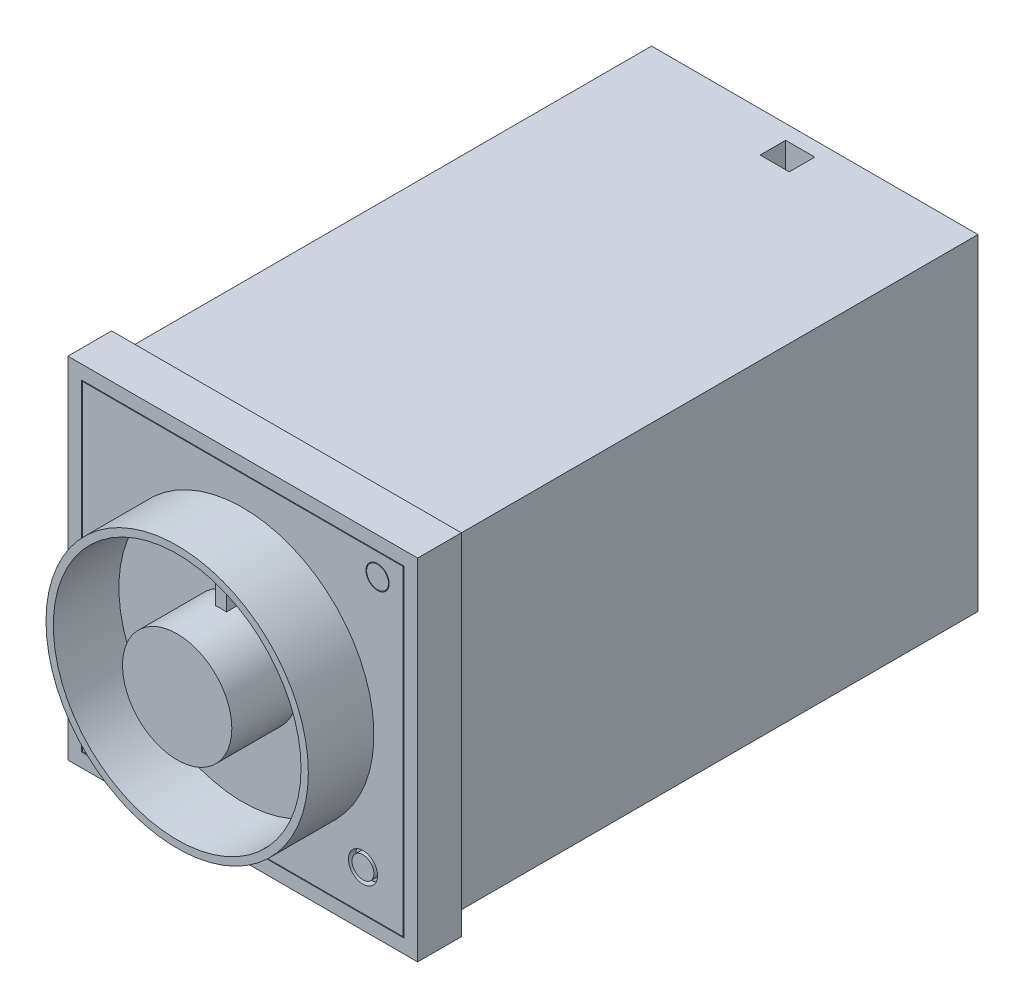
ISO-10303-21;
HEADER;
FILE_DESCRIPTION(('STEP AP214'),'2;1');
FILE_NAME('part.step','',(''),(''),'','','');
FILE_SCHEMA(('AUTOMOTIVE_DESIGN { 1 0 10303 214 1 1 1 1 }'));
ENDSEC;
DATA;
#1=APPLICATION_CONTEXT('core data for automotive mechanical design processes');
#2=APPLICATION_PROTOCOL_DEFINITION('international standard','automotive_design',2000,#1);
#3=PRODUCT_CONTEXT('',#1,'mechanical');
#4=PRODUCT('Part','Part','',(#3));
#5=PRODUCT_RELATED_PRODUCT_CATEGORY('part','',(#4));
#6=PRODUCT_DEFINITION_FORMATION('','',#4);
#7=PRODUCT_DEFINITION_CONTEXT('part definition',#1,'design');
#8=PRODUCT_DEFINITION('design','',#6,#7);
#9=PRODUCT_DEFINITION_SHAPE('','',#8);
#10=(LENGTH_UNIT() NAMED_UNIT(*) SI_UNIT(.MILLI.,.METRE.));
#11=(NAMED_UNIT(*) PLANE_ANGLE_UNIT() SI_UNIT($,.RADIAN.));
#12=(NAMED_UNIT(*) SI_UNIT($,.STERADIAN.) SOLID_ANGLE_UNIT());
#13=UNCERTAINTY_MEASURE_WITH_UNIT(LENGTH_MEASURE(1.E-05),#10,'distance_accuracy_value','');
#14=(GEOMETRIC_REPRESENTATION_CONTEXT(3) GLOBAL_UNCERTAINTY_ASSIGNED_CONTEXT((#13)) GLOBAL_UNIT_ASSIGNED_CONTEXT((#10,
#11,#12)) REPRESENTATION_CONTEXT('',''));
#15=CARTESIAN_POINT('',(0.,0.,0.));
#16=DIRECTION('',(0.,0.,1.));
#17=DIRECTION('',(1.,0.,0.));
#18=AXIS2_PLACEMENT_3D('',#15,#16,#17);
#19=CARTESIAN_POINT('',(0.,0.,-73.2));
#20=DIRECTION('',(0.,0.,-1.));
#21=DIRECTION('',(-1.,0.,0.));
#22=AXIS2_PLACEMENT_3D('',#19,#20,#21);
#23=PLANE('',#22);
#24=CARTESIAN_POINT('',(-8.06084892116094,-3.3389129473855,-73.2));
#25=DIRECTION('',(0.,0.,-1.));
#26=DIRECTION('',(0.,1.,0.));
#27=AXIS2_PLACEMENT_3D('',#24,#25,#26);
#28=CIRCLE('',#27,1.);
#29=CARTESIAN_POINT('',(-8.06084892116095,-2.3389129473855,-73.2));
#30=VERTEX_POINT('',#29);
#31=EDGE_CURVE('E736',#30,#30,#28,.T.);
#32=ORIENTED_EDGE('',*,*,#31,.F.);
#33=EDGE_LOOP('',(#32));
#34=FACE_BOUND('',#33,.T.);
#35=CARTESIAN_POINT('',(-3.33891294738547,8.06084892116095,-73.2));
#36=DIRECTION('',(0.,0.,-1.));
#37=DIRECTION('',(1.,0.,0.));
#38=AXIS2_PLACEMENT_3D('',#35,#36,#37);
#39=CIRCLE('',#38,1.);
#40=CARTESIAN_POINT('',(-2.33891294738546,8.06084892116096,-73.2));
#41=VERTEX_POINT('',#40);
#42=EDGE_CURVE('E748',#41,#41,#39,.T.);
#43=ORIENTED_EDGE('',*,*,#42,.F.);
#44=EDGE_LOOP('',(#43));
#45=FACE_BOUND('',#44,.T.);
#46=CARTESIAN_POINT('',(8.06084892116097,3.33891294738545,-73.2));
#47=DIRECTION('',(0.,0.,-1.));
#48=DIRECTION('',(0.,-1.,0.));
#49=AXIS2_PLACEMENT_3D('',#46,#47,#48);
#50=CIRCLE('',#49,1.);
#51=CARTESIAN_POINT('',(8.06084892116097,2.33891294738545,-73.2));
#52=VERTEX_POINT('',#51);
#53=EDGE_CURVE('E758',#52,#52,#50,.T.);
#54=ORIENTED_EDGE('',*,*,#53,.F.);
#55=EDGE_LOOP('',(#54));
#56=FACE_BOUND('',#55,.T.);
#57=CARTESIAN_POINT('',(3.33891294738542,-8.06084892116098,-73.2));
#58=DIRECTION('',(0.,0.,-1.));
#59=DIRECTION('',(-1.,0.,0.));
#60=AXIS2_PLACEMENT_3D('',#57,#58,#59);
#61=CIRCLE('',#60,1.);
#62=CARTESIAN_POINT('',(2.33891294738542,-8.06084892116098,-73.2));
#63=VERTEX_POINT('',#62);
#64=EDGE_CURVE('E412',#63,#63,#61,.T.);
#65=ORIENTED_EDGE('',*,*,#64,.F.);
#66=EDGE_LOOP('',(#65));
#67=FACE_BOUND('',#66,.T.);
#68=CARTESIAN_POINT('',(0.,0.,-73.2));
#69=DIRECTION('',(0.,0.,-1.));
#70=DIRECTION('',(-1.,0.,0.));
#71=AXIS2_PLACEMENT_3D('',#68,#69,#70);
#72=CIRCLE('',#71,13.5);
#73=CARTESIAN_POINT('',(-13.5,0.,-73.2));
#74=VERTEX_POINT('',#73);
#75=EDGE_CURVE('E459',#74,#74,#72,.T.);
#76=ORIENTED_EDGE('',*,*,#75,.T.);
#77=EDGE_LOOP('',(#76));
#78=FACE_BOUND('',#77,.T.);
#79=CARTESIAN_POINT('',(0.,0.,-73.2));
#80=DIRECTION('',(0.,0.,-1.));
#81=DIRECTION('',(-1.,0.,0.));
#82=AXIS2_PLACEMENT_3D('',#79,#80,#81);
#83=CIRCLE('',#82,4.);
#84=CARTESIAN_POINT('',(-1.,-3.87298334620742,-73.2));
#85=VERTEX_POINT('',#84);
#86=CARTESIAN_POINT('',(1.,-3.87298334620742,-73.2));
#87=VERTEX_POINT('',#86);
#88=EDGE_CURVE('E450',#85,#87,#83,.T.);
#89=ORIENTED_EDGE('',*,*,#88,.F.);
#90=DIRECTION('',(0.,1.,0.));
#91=VECTOR('',#90,1.);
#92=CARTESIAN_POINT('',(-1.,-3.87298334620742,-73.2));
#93=LINE('',#92,#91);
#94=CARTESIAN_POINT('',(-1.,-5.,-73.2));
#95=VERTEX_POINT('',#94);
#96=EDGE_CURVE('E424',#95,#85,#93,.T.);
#97=ORIENTED_EDGE('',*,*,#96,.F.);
#98=DIRECTION('',(-1.,0.,0.));
#99=VECTOR('',#98,1.);
#100=CARTESIAN_POINT('',(1.,-5.,-73.2));
#101=LINE('',#100,#99);
#102=CARTESIAN_POINT('',(1.,-5.,-73.2));
#103=VERTEX_POINT('',#102);
#104=EDGE_CURVE('E428',#103,#95,#101,.T.);
#105=ORIENTED_EDGE('',*,*,#104,.F.);
#106=DIRECTION('',(0.,-1.,0.));
#107=VECTOR('',#106,1.);
#108=CARTESIAN_POINT('',(1.,-3.87298334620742,-73.2));
#109=LINE('',#108,#107);
#110=EDGE_CURVE('E426',#87,#103,#109,.T.);
#111=ORIENTED_EDGE('',*,*,#110,.F.);
#112=EDGE_LOOP('',(#89,#97,#105,#111));
#113=FACE_BOUND('',#112,.T.);
#114=CARTESIAN_POINT('',(8.06084892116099,-3.33891294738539,-73.2));
#115=DIRECTION('',(0.,0.,-1.));
#116=DIRECTION('',(-0.707106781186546,-0.707106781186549,0.));
#117=AXIS2_PLACEMENT_3D('',#114,#115,#116);
#118=CIRCLE('',#117,1.);
#119=CARTESIAN_POINT('',(7.35374213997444,-4.04601972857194,-73.2));
#120=VERTEX_POINT('',#119);
#121=EDGE_CURVE('E720',#120,#120,#118,.T.);
#122=ORIENTED_EDGE('',*,*,#121,.F.);
#123=EDGE_LOOP('',(#122));
#124=FACE_BOUND('',#123,.T.);
#125=CARTESIAN_POINT('',(3.33891294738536,8.060848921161,-73.2));
#126=DIRECTION('',(0.,0.,-1.));
#127=DIRECTION('',(0.707106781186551,-0.707106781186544,0.));
#128=AXIS2_PLACEMENT_3D('',#125,#126,#127);
#129=CIRCLE('',#128,1.);
#130=CARTESIAN_POINT('',(4.04601972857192,7.35374213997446,-73.2));
#131=VERTEX_POINT('',#130);
#132=EDGE_CURVE('E724',#131,#131,#129,.T.);
#133=ORIENTED_EDGE('',*,*,#132,.F.);
#134=EDGE_LOOP('',(#133));
#135=FACE_BOUND('',#134,.T.);
#136=CARTESIAN_POINT('',(-8.06084892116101,3.33891294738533,-73.2));
#137=DIRECTION('',(0.,0.,-1.));
#138=DIRECTION('',(0.707106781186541,0.707106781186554,0.));
#139=AXIS2_PLACEMENT_3D('',#136,#137,#138);
#140=CIRCLE('',#139,1.);
#141=CARTESIAN_POINT('',(-7.35374213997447,4.04601972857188,-73.2));
#142=VERTEX_POINT('',#141);
#143=EDGE_CURVE('E728',#142,#142,#140,.T.);
#144=ORIENTED_EDGE('',*,*,#143,.F.);
#145=EDGE_LOOP('',(#144));
#146=FACE_BOUND('',#145,.T.);
#147=CARTESIAN_POINT('',(-3.3389129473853,-8.06084892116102,-73.2));
#148=DIRECTION('',(0.,0.,-1.));
#149=DIRECTION('',(-0.707106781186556,0.707106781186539,0.));
#150=AXIS2_PLACEMENT_3D('',#147,#148,#149);
#151=CIRCLE('',#150,1.);
#152=CARTESIAN_POINT('',(-4.04601972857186,-7.35374213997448,-73.2));
#153=VERTEX_POINT('',#152);
#154=EDGE_CURVE('E731',#153,#153,#151,.T.);
#155=ORIENTED_EDGE('',*,*,#154,.F.);
#156=EDGE_LOOP('',(#155));
#157=FACE_BOUND('',#156,.T.);
#158=ADVANCED_FACE('F16',(#34,#45,#56,#67,#78,#113,#124,#135,#146,#157),#23,.T.);
#159=CARTESIAN_POINT('',(24.,-24.,6.));
#160=DIRECTION('',(0.,0.,-1.));
#161=DIRECTION('',(-1.,0.,0.));
#162=AXIS2_PLACEMENT_3D('',#159,#160,#161);
#163=PLANE('',#162);
#164=DIRECTION('',(1.,0.,0.));
#165=VECTOR('',#164,1.);
#166=CARTESIAN_POINT('',(-22.,-22.1,6.));
#167=LINE('',#166,#165);
#168=CARTESIAN_POINT('',(-22.1,-22.1,6.));
#169=VERTEX_POINT('',#168);
#170=CARTESIAN_POINT('',(22.1,-22.1,6.));
#171=VERTEX_POINT('',#170);
#172=EDGE_CURVE('E264',#169,#171,#167,.T.);
#173=ORIENTED_EDGE('',*,*,#172,.F.);
#174=DIRECTION('',(0.,-1.,0.));
#175=VECTOR('',#174,1.);
#176=CARTESIAN_POINT('',(-22.1,22.,6.));
#177=LINE('',#176,#175);
#178=CARTESIAN_POINT('',(-22.1,22.1,6.));
#179=VERTEX_POINT('',#178);
#180=EDGE_CURVE('E31',#179,#169,#177,.T.);
#181=ORIENTED_EDGE('',*,*,#180,.F.);
#182=DIRECTION('',(-1.,0.,0.));
#183=VECTOR('',#182,1.);
#184=CARTESIAN_POINT('',(-22.,22.1,6.));
#185=LINE('',#184,#183);
#186=CARTESIAN_POINT('',(22.1,22.1,6.));
#187=VERTEX_POINT('',#186);
#188=EDGE_CURVE('E270',#187,#179,#185,.T.);
#189=ORIENTED_EDGE('',*,*,#188,.F.);
#190=DIRECTION('',(0.,1.,0.));
#191=VECTOR('',#190,1.);
#192=CARTESIAN_POINT('',(22.1,22.,6.));
#193=LINE('',#192,#191);
#194=EDGE_CURVE('E267',#171,#187,#193,.T.);
#195=ORIENTED_EDGE('',*,*,#194,.F.);
#196=EDGE_LOOP('',(#173,#181,#189,#195));
#197=FACE_BOUND('',#196,.T.);
#198=DIRECTION('',(0.,-1.,0.));
#199=VECTOR('',#198,1.);
#200=CARTESIAN_POINT('',(24.,24.,6.));
#201=LINE('',#200,#199);
#202=CARTESIAN_POINT('',(24.,24.,6.));
#203=VERTEX_POINT('',#202);
#204=CARTESIAN_POINT('',(24.,-24.,6.));
#205=VERTEX_POINT('',#204);
#206=EDGE_CURVE('E474',#203,#205,#201,.T.);
#207=ORIENTED_EDGE('',*,*,#206,.F.);
#208=DIRECTION('',(1.,0.,0.));
#209=VECTOR('',#208,1.);
#210=CARTESIAN_POINT('',(24.,24.,6.));
#211=LINE('',#210,#209);
#212=CARTESIAN_POINT('',(-24.,24.,6.));
#213=VERTEX_POINT('',#212);
#214=EDGE_CURVE('E483',#213,#203,#211,.T.);
#215=ORIENTED_EDGE('',*,*,#214,.F.);
#216=DIRECTION('',(0.,1.,0.));
#217=VECTOR('',#216,1.);
#218=CARTESIAN_POINT('',(-24.,24.,6.));
#219=LINE('',#218,#217);
#220=CARTESIAN_POINT('',(-24.,-24.,6.));
#221=VERTEX_POINT('',#220);
#222=EDGE_CURVE('E480',#221,#213,#219,.T.);
#223=ORIENTED_EDGE('',*,*,#222,.F.);
#224=DIRECTION('',(-1.,0.,0.));
#225=VECTOR('',#224,1.);
#226=CARTESIAN_POINT('',(24.,-24.,6.));
#227=LINE('',#226,#225);
#228=EDGE_CURVE('E477',#205,#221,#227,.T.);
#229=ORIENTED_EDGE('',*,*,#228,.F.);
#230=EDGE_LOOP('',(#207,#215,#223,#229));
#231=FACE_BOUND('',#230,.T.);
#232=ADVANCED_FACE('F562',(#197,#231),#163,.F.);
#233=CARTESIAN_POINT('',(22.4,-22.4,-72.5));
#234=DIRECTION('',(0.,1.,0.));
#235=DIRECTION('',(0.,0.,1.));
#236=AXIS2_PLACEMENT_3D('',#233,#234,#235);
#237=PLANE('',#236);
#238=DIRECTION('',(-1.,0.,0.));
#239=VECTOR('',#238,1.);
#240=CARTESIAN_POINT('',(22.4,-22.4,0.));
#241=LINE('',#240,#239);
#242=CARTESIAN_POINT('',(22.4,-22.4,0.));
#243=VERTEX_POINT('',#242);
#244=CARTESIAN_POINT('',(-22.4,-22.4,0.));
#245=VERTEX_POINT('',#244);
#246=EDGE_CURVE('E497',#243,#245,#241,.T.);
#247=ORIENTED_EDGE('',*,*,#246,.T.);
#248=DIRECTION('',(0.,0.,1.));
#249=VECTOR('',#248,1.);
#250=CARTESIAN_POINT('',(-22.4,-22.4,-72.5));
#251=LINE('',#250,#249);
#252=CARTESIAN_POINT('',(-22.4,-22.4,-72.5));
#253=VERTEX_POINT('',#252);
#254=EDGE_CURVE('E521',#253,#245,#251,.T.);
#255=ORIENTED_EDGE('',*,*,#254,.F.);
#256=DIRECTION('',(-1.,0.,0.));
#257=VECTOR('',#256,1.);
#258=CARTESIAN_POINT('',(22.4,-22.4,-72.5));
#259=LINE('',#258,#257);
#260=CARTESIAN_POINT('',(22.4,-22.4,-72.5));
#261=VERTEX_POINT('',#260);
#262=EDGE_CURVE('E509',#261,#253,#259,.T.);
#263=ORIENTED_EDGE('',*,*,#262,.F.);
#264=DIRECTION('',(0.,0.,1.));
#265=VECTOR('',#264,1.);
#266=CARTESIAN_POINT('',(22.4,-22.4,-72.5));
#267=LINE('',#266,#265);
#268=EDGE_CURVE('E524',#261,#243,#267,.T.);
#269=ORIENTED_EDGE('',*,*,#268,.T.);
#270=EDGE_LOOP('',(#247,#255,#263,#269));
#271=FACE_BOUND('',#270,.T.);
#272=DIRECTION('',(0.,0.,-1.));
#273=VECTOR('',#272,1.);
#274=CARTESIAN_POINT('',(2.,-22.4,-70.5));
#275=LINE('',#274,#273);
#276=CARTESIAN_POINT('',(2.,-22.4,-67.));
#277=VERTEX_POINT('',#276);
#278=CARTESIAN_POINT('',(2.,-22.4,-70.5));
#279=VERTEX_POINT('',#278);
#280=EDGE_CURVE('E355',#277,#279,#275,.T.);
#281=ORIENTED_EDGE('',*,*,#280,.T.);
#282=DIRECTION('',(-1.,0.,0.));
#283=VECTOR('',#282,1.);
#284=CARTESIAN_POINT('',(2.,-22.4,-70.5));
#285=LINE('',#284,#283);
#286=CARTESIAN_POINT('',(-2.,-22.4,-70.5));
#287=VERTEX_POINT('',#286);
#288=EDGE_CURVE('E364',#279,#287,#285,.T.);
#289=ORIENTED_EDGE('',*,*,#288,.T.);
#290=DIRECTION('',(0.,0.,1.));
#291=VECTOR('',#290,1.);
#292=CARTESIAN_POINT('',(-2.,-22.4,-70.5));
#293=LINE('',#292,#291);
#294=CARTESIAN_POINT('',(-2.,-22.4,-67.));
#295=VERTEX_POINT('',#294);
#296=EDGE_CURVE('E361',#287,#295,#293,.T.);
#297=ORIENTED_EDGE('',*,*,#296,.T.);
#298=DIRECTION('',(1.,0.,0.));
#299=VECTOR('',#298,1.);
#300=CARTESIAN_POINT('',(2.,-22.4,-67.));
#301=LINE('',#300,#299);
#302=EDGE_CURVE('E358',#295,#277,#301,.T.);
#303=ORIENTED_EDGE('',*,*,#302,.T.);
#304=EDGE_LOOP('',(#281,#289,#297,#303));
#305=FACE_BOUND('',#304,.T.);
#306=ADVANCED_FACE('F569',(#271,#305),#237,.F.);
#307=CARTESIAN_POINT('',(0.,0.,-86.7));
#308=DIRECTION('',(0.,0.,1.));
#309=DIRECTION('',(1.,0.,0.));
#310=AXIS2_PLACEMENT_3D('',#307,#308,#309);
#311=CYLINDRICAL_SURFACE('',#310,4.);
#312=CARTESIAN_POINT('',(0.,0.,-86.7));
#313=DIRECTION('',(0.,0.,-1.));
#314=DIRECTION('',(-1.,0.,0.));
#315=AXIS2_PLACEMENT_3D('',#312,#313,#314);
#316=CIRCLE('',#315,4.);
#317=CARTESIAN_POINT('',(-3.99999999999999,0.,-86.7));
#318=VERTEX_POINT('',#317);
#319=EDGE_CURVE('E453',#318,#318,#316,.T.);
#320=ORIENTED_EDGE('',*,*,#319,.F.);
#321=EDGE_LOOP('',(#320));
#322=FACE_BOUND('',#321,.T.);
#323=DIRECTION('',(0.,0.,1.));
#324=VECTOR('',#323,1.);
#325=CARTESIAN_POINT('',(-1.,-3.87298334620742,-85.2));
#326=LINE('',#325,#324);
#327=CARTESIAN_POINT('',(-1.,-3.87298334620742,-85.2));
#328=VERTEX_POINT('',#327);
#329=EDGE_CURVE('E447',#328,#85,#326,.T.);
#330=ORIENTED_EDGE('',*,*,#329,.T.);
#331=ORIENTED_EDGE('',*,*,#88,.T.);
#332=DIRECTION('',(0.,0.,1.));
#333=VECTOR('',#332,1.);
#334=CARTESIAN_POINT('',(1.,-3.87298334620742,-85.2));
#335=LINE('',#334,#333);
#336=CARTESIAN_POINT('',(1.,-3.87298334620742,-85.2));
#337=VERTEX_POINT('',#336);
#338=EDGE_CURVE('E445',#337,#87,#335,.T.);
#339=ORIENTED_EDGE('',*,*,#338,.F.);
#340=CARTESIAN_POINT('',(0.,0.,-85.2));
#341=DIRECTION('',(0.,0.,1.));
#342=DIRECTION('',(-1.,0.,0.));
#343=AXIS2_PLACEMENT_3D('',#340,#341,#342);
#344=CIRCLE('',#343,4.);
#345=EDGE_CURVE('E433',#328,#337,#344,.T.);
#346=ORIENTED_EDGE('',*,*,#345,.F.);
#347=EDGE_LOOP('',(#330,#331,#339,#346));
#348=FACE_BOUND('',#347,.T.);
#349=ADVANCED_FACE('F575',(#322,#348),#311,.T.);
#350=CARTESIAN_POINT('',(22.4,-22.4,-72.5));
#351=DIRECTION('',(0.,0.,-1.));
#352=DIRECTION('',(-1.,0.,0.));
#353=AXIS2_PLACEMENT_3D('',#350,#351,#352);
#354=PLANE('',#353);
#355=DIRECTION('',(0.,-1.,0.));
#356=VECTOR('',#355,1.);
#357=CARTESIAN_POINT('',(22.4,22.4,-72.5));
#358=LINE('',#357,#356);
#359=CARTESIAN_POINT('',(22.4,22.4,-72.5));
#360=VERTEX_POINT('',#359);
#361=EDGE_CURVE('E506',#360,#261,#358,.T.);
#362=ORIENTED_EDGE('',*,*,#361,.T.);
#363=ORIENTED_EDGE('',*,*,#262,.T.);
#364=DIRECTION('',(0.,1.,0.));
#365=VECTOR('',#364,1.);
#366=CARTESIAN_POINT('',(-22.4,22.4,-72.5));
#367=LINE('',#366,#365);
#368=CARTESIAN_POINT('',(-22.4,22.4,-72.5));
#369=VERTEX_POINT('',#368);
#370=EDGE_CURVE('E511',#253,#369,#367,.T.);
#371=ORIENTED_EDGE('',*,*,#370,.T.);
#372=DIRECTION('',(1.,0.,0.));
#373=VECTOR('',#372,1.);
#374=CARTESIAN_POINT('',(22.4,22.4,-72.5));
#375=LINE('',#374,#373);
#376=EDGE_CURVE('E513',#369,#360,#375,.T.);
#377=ORIENTED_EDGE('',*,*,#376,.T.);
#378=EDGE_LOOP('',(#362,#363,#371,#377));
#379=FACE_BOUND('',#378,.T.);
#380=CARTESIAN_POINT('',(0.,0.,-72.5));
#381=DIRECTION('',(0.,0.,-1.));
#382=DIRECTION('',(-1.,0.,0.));
#383=AXIS2_PLACEMENT_3D('',#380,#381,#382);
#384=CIRCLE('',#383,13.5);
#385=CARTESIAN_POINT('',(-13.5,0.,-72.5));
#386=VERTEX_POINT('',#385);
#387=EDGE_CURVE('E456',#386,#386,#384,.T.);
#388=ORIENTED_EDGE('',*,*,#387,.F.);
#389=EDGE_LOOP('',(#388));
#390=FACE_BOUND('',#389,.T.);
#391=ADVANCED_FACE('F606',(#379,#390),#354,.T.);
#392=CARTESIAN_POINT('',(22.4,22.4,-72.5));
#393=DIRECTION('',(-1.,0.,0.));
#394=DIRECTION('',(0.,0.,1.));
#395=AXIS2_PLACEMENT_3D('',#392,#393,#394);
#396=PLANE('',#395);
#397=DIRECTION('',(0.,-1.,0.));
#398=VECTOR('',#397,1.);
#399=CARTESIAN_POINT('',(22.4,22.4,0.));
#400=LINE('',#399,#398);
#401=CARTESIAN_POINT('',(22.4,22.4,0.));
#402=VERTEX_POINT('',#401);
#403=EDGE_CURVE('E489',#402,#243,#400,.T.);
#404=ORIENTED_EDGE('',*,*,#403,.T.);
#405=ORIENTED_EDGE('',*,*,#268,.F.);
#406=ORIENTED_EDGE('',*,*,#361,.F.);
#407=DIRECTION('',(0.,0.,1.));
#408=VECTOR('',#407,1.);
#409=CARTESIAN_POINT('',(22.4,22.4,-72.5));
#410=LINE('',#409,#408);
#411=EDGE_CURVE('E515',#360,#402,#410,.T.);
#412=ORIENTED_EDGE('',*,*,#411,.T.);
#413=EDGE_LOOP('',(#404,#405,#406,#412));
#414=FACE_BOUND('',#413,.T.);
#415=ADVANCED_FACE('F18',(#414),#396,.F.);
#416=CARTESIAN_POINT('',(-22.4,22.4,-72.5));
#417=DIRECTION('',(1.,0.,0.));
#418=DIRECTION('',(0.,0.,-1.));
#419=AXIS2_PLACEMENT_3D('',#416,#417,#418);
#420=PLANE('',#419);
#421=DIRECTION('',(0.,1.,0.));
#422=VECTOR('',#421,1.);
#423=CARTESIAN_POINT('',(-22.4,22.4,0.));
#424=LINE('',#423,#422);
#425=CARTESIAN_POINT('',(-22.4,22.4,0.));
#426=VERTEX_POINT('',#425);
#427=EDGE_CURVE('E500',#245,#426,#424,.T.);
#428=ORIENTED_EDGE('',*,*,#427,.T.);
#429=DIRECTION('',(0.,0.,1.));
#430=VECTOR('',#429,1.);
#431=CARTESIAN_POINT('',(-22.4,22.4,-72.5));
#432=LINE('',#431,#430);
#433=EDGE_CURVE('E518',#369,#426,#432,.T.);
#434=ORIENTED_EDGE('',*,*,#433,.F.);
#435=ORIENTED_EDGE('',*,*,#370,.F.);
#436=ORIENTED_EDGE('',*,*,#254,.T.);
#437=EDGE_LOOP('',(#428,#434,#435,#436));
#438=FACE_BOUND('',#437,.T.);
#439=ADVANCED_FACE('F612',(#438),#420,.F.);
#440=CARTESIAN_POINT('',(22.4,22.4,-72.5));
#441=DIRECTION('',(0.,-1.,0.));
#442=DIRECTION('',(0.,0.,-1.));
#443=AXIS2_PLACEMENT_3D('',#440,#441,#442);
#444=PLANE('',#443);
#445=DIRECTION('',(-1.,0.,0.));
#446=VECTOR('',#445,1.);
#447=CARTESIAN_POINT('',(2.,22.4,-70.5));
#448=LINE('',#447,#446);
#449=CARTESIAN_POINT('',(2.,22.4,-70.5));
#450=VERTEX_POINT('',#449);
#451=CARTESIAN_POINT('',(-2.,22.4,-70.5));
#452=VERTEX_POINT('',#451);
#453=EDGE_CURVE('E388',#450,#452,#448,.T.);
#454=ORIENTED_EDGE('',*,*,#453,.F.);
#455=DIRECTION('',(0.,0.,-1.));
#456=VECTOR('',#455,1.);
#457=CARTESIAN_POINT('',(2.,22.4,-70.5));
#458=LINE('',#457,#456);
#459=CARTESIAN_POINT('',(2.,22.4,-67.));
#460=VERTEX_POINT('',#459);
#461=EDGE_CURVE('E380',#460,#450,#458,.T.);
#462=ORIENTED_EDGE('',*,*,#461,.F.);
#463=DIRECTION('',(1.,0.,0.));
#464=VECTOR('',#463,1.);
#465=CARTESIAN_POINT('',(2.,22.4,-67.));
#466=LINE('',#465,#464);
#467=CARTESIAN_POINT('',(-2.,22.4,-67.));
#468=VERTEX_POINT('',#467);
#469=EDGE_CURVE('E394',#468,#460,#466,.T.);
#470=ORIENTED_EDGE('',*,*,#469,.F.);
#471=DIRECTION('',(0.,0.,1.));
#472=VECTOR('',#471,1.);
#473=CARTESIAN_POINT('',(-2.,22.4,-70.5));
#474=LINE('',#473,#472);
#475=EDGE_CURVE('E391',#452,#468,#474,.T.);
#476=ORIENTED_EDGE('',*,*,#475,.F.);
#477=EDGE_LOOP('',(#454,#462,#470,#476));
#478=FACE_BOUND('',#477,.T.);
#479=DIRECTION('',(1.,0.,0.));
#480=VECTOR('',#479,1.);
#481=CARTESIAN_POINT('',(22.4,22.4,0.));
#482=LINE('',#481,#480);
#483=EDGE_CURVE('E503',#426,#402,#482,.T.);
#484=ORIENTED_EDGE('',*,*,#483,.T.);
#485=ORIENTED_EDGE('',*,*,#411,.F.);
#486=ORIENTED_EDGE('',*,*,#376,.F.);
#487=ORIENTED_EDGE('',*,*,#433,.T.);
#488=EDGE_LOOP('',(#484,#485,#486,#487));
#489=FACE_BOUND('',#488,.T.);
#490=ADVANCED_FACE('F586',(#478,#489),#444,.F.);
#491=CARTESIAN_POINT('',(24.,-24.,0.));
#492=DIRECTION('',(0.,0.,-1.));
#493=DIRECTION('',(-1.,0.,0.));
#494=AXIS2_PLACEMENT_3D('',#491,#492,#493);
#495=PLANE('',#494);
#496=DIRECTION('',(0.,-1.,0.));
#497=VECTOR('',#496,1.);
#498=CARTESIAN_POINT('',(24.,24.,0.));
#499=LINE('',#498,#497);
#500=CARTESIAN_POINT('',(24.,24.,0.));
#501=VERTEX_POINT('',#500);
#502=CARTESIAN_POINT('',(24.,-24.,0.));
#503=VERTEX_POINT('',#502);
#504=EDGE_CURVE('E462',#501,#503,#499,.T.);
#505=ORIENTED_EDGE('',*,*,#504,.T.);
#506=DIRECTION('',(-1.,0.,0.));
#507=VECTOR('',#506,1.);
#508=CARTESIAN_POINT('',(24.,-24.,0.));
#509=LINE('',#508,#507);
#510=CARTESIAN_POINT('',(-24.,-24.,0.));
#511=VERTEX_POINT('',#510);
#512=EDGE_CURVE('E465',#503,#511,#509,.T.);
#513=ORIENTED_EDGE('',*,*,#512,.T.);
#514=DIRECTION('',(0.,1.,0.));
#515=VECTOR('',#514,1.);
#516=CARTESIAN_POINT('',(-24.,24.,0.));
#517=LINE('',#516,#515);
#518=CARTESIAN_POINT('',(-24.,24.,0.));
#519=VERTEX_POINT('',#518);
#520=EDGE_CURVE('E468',#511,#519,#517,.T.);
#521=ORIENTED_EDGE('',*,*,#520,.T.);
#522=DIRECTION('',(1.,0.,0.));
#523=VECTOR('',#522,1.);
#524=CARTESIAN_POINT('',(24.,24.,0.));
#525=LINE('',#524,#523);
#526=EDGE_CURVE('E471',#519,#501,#525,.T.);
#527=ORIENTED_EDGE('',*,*,#526,.T.);
#528=EDGE_LOOP('',(#505,#513,#521,#527));
#529=FACE_BOUND('',#528,.T.);
#530=ORIENTED_EDGE('',*,*,#403,.F.);
#531=ORIENTED_EDGE('',*,*,#483,.F.);
#532=ORIENTED_EDGE('',*,*,#427,.F.);
#533=ORIENTED_EDGE('',*,*,#246,.F.);
#534=EDGE_LOOP('',(#530,#531,#532,#533));
#535=FACE_BOUND('',#534,.T.);
#536=ADVANCED_FACE('F583',(#529,#535),#495,.T.);
#537=CARTESIAN_POINT('',(24.,24.,6.));
#538=DIRECTION('',(1.,0.,0.));
#539=DIRECTION('',(0.,0.,-1.));
#540=AXIS2_PLACEMENT_3D('',#537,#538,#539);
#541=PLANE('',#540);
#542=ORIENTED_EDGE('',*,*,#504,.F.);
#543=DIRECTION('',(0.,0.,-1.));
#544=VECTOR('',#543,1.);
#545=CARTESIAN_POINT('',(24.,24.,6.));
#546=LINE('',#545,#544);
#547=EDGE_CURVE('E487',#203,#501,#546,.T.);
#548=ORIENTED_EDGE('',*,*,#547,.F.);
#549=ORIENTED_EDGE('',*,*,#206,.T.);
#550=DIRECTION('',(0.,0.,-1.));
#551=VECTOR('',#550,1.);
#552=CARTESIAN_POINT('',(24.,-24.,6.));
#553=LINE('',#552,#551);
#554=EDGE_CURVE('E486',#205,#503,#553,.T.);
#555=ORIENTED_EDGE('',*,*,#554,.T.);
#556=EDGE_LOOP('',(#542,#548,#549,#555));
#557=FACE_BOUND('',#556,.T.);
#558=ADVANCED_FACE('F585',(#557),#541,.T.);
#559=CARTESIAN_POINT('',(24.,24.,6.));
#560=DIRECTION('',(0.,1.,0.));
#561=DIRECTION('',(-1.,0.,0.));
#562=AXIS2_PLACEMENT_3D('',#559,#560,#561);
#563=PLANE('',#562);
#564=ORIENTED_EDGE('',*,*,#526,.F.);
#565=DIRECTION('',(0.,0.,-1.));
#566=VECTOR('',#565,1.);
#567=CARTESIAN_POINT('',(-24.,24.,6.));
#568=LINE('',#567,#566);
#569=EDGE_CURVE('E490',#213,#519,#568,.T.);
#570=ORIENTED_EDGE('',*,*,#569,.F.);
#571=ORIENTED_EDGE('',*,*,#214,.T.);
#572=ORIENTED_EDGE('',*,*,#547,.T.);
#573=EDGE_LOOP('',(#564,#570,#571,#572));
#574=FACE_BOUND('',#573,.T.);
#575=ADVANCED_FACE('F592',(#574),#563,.T.);
#576=CARTESIAN_POINT('',(-24.,24.,6.));
#577=DIRECTION('',(-1.,0.,0.));
#578=DIRECTION('',(0.,-1.,0.));
#579=AXIS2_PLACEMENT_3D('',#576,#577,#578);
#580=PLANE('',#579);
#581=ORIENTED_EDGE('',*,*,#520,.F.);
#582=DIRECTION('',(0.,0.,-1.));
#583=VECTOR('',#582,1.);
#584=CARTESIAN_POINT('',(-24.,-24.,6.));
#585=LINE('',#584,#583);
#586=EDGE_CURVE('E492',#221,#511,#585,.T.);
#587=ORIENTED_EDGE('',*,*,#586,.F.);
#588=ORIENTED_EDGE('',*,*,#222,.T.);
#589=ORIENTED_EDGE('',*,*,#569,.T.);
#590=EDGE_LOOP('',(#581,#587,#588,#589));
#591=FACE_BOUND('',#590,.T.);
#592=ADVANCED_FACE('F595',(#591),#580,.T.);
#593=CARTESIAN_POINT('',(24.,-24.,6.));
#594=DIRECTION('',(0.,-1.,0.));
#595=DIRECTION('',(1.,0.,0.));
#596=AXIS2_PLACEMENT_3D('',#593,#594,#595);
#597=PLANE('',#596);
#598=ORIENTED_EDGE('',*,*,#512,.F.);
#599=ORIENTED_EDGE('',*,*,#554,.F.);
#600=ORIENTED_EDGE('',*,*,#228,.T.);
#601=ORIENTED_EDGE('',*,*,#586,.T.);
#602=EDGE_LOOP('',(#598,#599,#600,#601));
#603=FACE_BOUND('',#602,.T.);
#604=ADVANCED_FACE('F581',(#603),#597,.T.);
#605=CARTESIAN_POINT('',(0.,0.,-73.2));
#606=DIRECTION('',(0.,0.,1.));
#607=DIRECTION('',(1.,0.,0.));
#608=AXIS2_PLACEMENT_3D('',#605,#606,#607);
#609=CYLINDRICAL_SURFACE('',#608,13.5);
#610=ORIENTED_EDGE('',*,*,#75,.F.);
#611=EDGE_LOOP('',(#610));
#612=FACE_BOUND('',#611,.T.);
#613=ORIENTED_EDGE('',*,*,#387,.T.);
#614=EDGE_LOOP('',(#613));
#615=FACE_BOUND('',#614,.T.);
#616=ADVANCED_FACE('F577',(#612,#615),#609,.T.);
#617=CARTESIAN_POINT('',(0.,0.,-86.7));
#618=DIRECTION('',(0.,0.,-1.));
#619=DIRECTION('',(-1.,0.,0.));
#620=AXIS2_PLACEMENT_3D('',#617,#618,#619);
#621=PLANE('',#620);
#622=ORIENTED_EDGE('',*,*,#319,.T.);
#623=EDGE_LOOP('',(#622));
#624=FACE_BOUND('',#623,.T.);
#625=ADVANCED_FACE('F580',(#624),#621,.T.);
#626=CARTESIAN_POINT('',(-1.,-3.87298334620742,-85.2));
#627=DIRECTION('',(1.,0.,0.));
#628=DIRECTION('',(0.,1.,0.));
#629=AXIS2_PLACEMENT_3D('',#626,#627,#628);
#630=PLANE('',#629);
#631=ORIENTED_EDGE('',*,*,#96,.T.);
#632=ORIENTED_EDGE('',*,*,#329,.F.);
#633=DIRECTION('',(0.,1.,0.));
#634=VECTOR('',#633,1.);
#635=CARTESIAN_POINT('',(-1.,-3.87298334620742,-85.2));
#636=LINE('',#635,#634);
#637=CARTESIAN_POINT('',(-1.,-5.,-85.2));
#638=VERTEX_POINT('',#637);
#639=EDGE_CURVE('E430',#638,#328,#636,.T.);
#640=ORIENTED_EDGE('',*,*,#639,.F.);
#641=DIRECTION('',(0.,0.,1.));
#642=VECTOR('',#641,1.);
#643=CARTESIAN_POINT('',(-1.,-5.,-85.2));
#644=LINE('',#643,#642);
#645=EDGE_CURVE('E439',#638,#95,#644,.T.);
#646=ORIENTED_EDGE('',*,*,#645,.T.);
#647=EDGE_LOOP('',(#631,#632,#640,#646));
#648=FACE_BOUND('',#647,.T.);
#649=ADVANCED_FACE('F694',(#648),#630,.F.);
#650=CARTESIAN_POINT('',(1.,-3.87298334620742,-85.2));
#651=DIRECTION('',(-1.,0.,0.));
#652=DIRECTION('',(0.,-1.,0.));
#653=AXIS2_PLACEMENT_3D('',#650,#651,#652);
#654=PLANE('',#653);
#655=ORIENTED_EDGE('',*,*,#110,.T.);
#656=DIRECTION('',(0.,0.,1.));
#657=VECTOR('',#656,1.);
#658=CARTESIAN_POINT('',(1.,-5.,-85.2));
#659=LINE('',#658,#657);
#660=CARTESIAN_POINT('',(1.,-5.,-85.2));
#661=VERTEX_POINT('',#660);
#662=EDGE_CURVE('E442',#661,#103,#659,.T.);
#663=ORIENTED_EDGE('',*,*,#662,.F.);
#664=DIRECTION('',(0.,-1.,0.));
#665=VECTOR('',#664,1.);
#666=CARTESIAN_POINT('',(1.,-3.87298334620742,-85.2));
#667=LINE('',#666,#665);
#668=EDGE_CURVE('E435',#337,#661,#667,.T.);
#669=ORIENTED_EDGE('',*,*,#668,.F.);
#670=ORIENTED_EDGE('',*,*,#338,.T.);
#671=EDGE_LOOP('',(#655,#663,#669,#670));
#672=FACE_BOUND('',#671,.T.);
#673=ADVANCED_FACE('F690',(#672),#654,.F.);
#674=CARTESIAN_POINT('',(1.,-5.,-85.2));
#675=DIRECTION('',(0.,1.,0.));
#676=DIRECTION('',(0.,0.,1.));
#677=AXIS2_PLACEMENT_3D('',#674,#675,#676);
#678=PLANE('',#677);
#679=ORIENTED_EDGE('',*,*,#104,.T.);
#680=ORIENTED_EDGE('',*,*,#645,.F.);
#681=DIRECTION('',(-1.,0.,0.));
#682=VECTOR('',#681,1.);
#683=CARTESIAN_POINT('',(1.,-5.,-85.2));
#684=LINE('',#683,#682);
#685=EDGE_CURVE('E437',#661,#638,#684,.T.);
#686=ORIENTED_EDGE('',*,*,#685,.F.);
#687=ORIENTED_EDGE('',*,*,#662,.T.);
#688=EDGE_LOOP('',(#679,#680,#686,#687));
#689=FACE_BOUND('',#688,.T.);
#690=ADVANCED_FACE('F686',(#689),#678,.F.);
#691=CARTESIAN_POINT('',(0.,0.,-85.2));
#692=DIRECTION('',(0.,0.,-1.));
#693=DIRECTION('',(-1.,0.,0.));
#694=AXIS2_PLACEMENT_3D('',#691,#692,#693);
#695=PLANE('',#694);
#696=ORIENTED_EDGE('',*,*,#639,.T.);
#697=ORIENTED_EDGE('',*,*,#345,.T.);
#698=ORIENTED_EDGE('',*,*,#668,.T.);
#699=ORIENTED_EDGE('',*,*,#685,.T.);
#700=EDGE_LOOP('',(#696,#697,#698,#699));
#701=FACE_BOUND('',#700,.T.);
#702=ADVANCED_FACE('F682',(#701),#695,.T.);
#703=CARTESIAN_POINT('',(3.33891294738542,-8.06084892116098,-83.7));
#704=DIRECTION('',(0.,0.,1.));
#705=DIRECTION('',(1.,0.,0.));
#706=AXIS2_PLACEMENT_3D('',#703,#704,#705);
#707=CYLINDRICAL_SURFACE('',#706,1.);
#708=CARTESIAN_POINT('',(3.33891294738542,-8.06084892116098,-83.7));
#709=DIRECTION('',(0.,0.,-1.));
#710=DIRECTION('',(-1.,0.,0.));
#711=AXIS2_PLACEMENT_3D('',#708,#709,#710);
#712=CIRCLE('',#711,1.);
#713=CARTESIAN_POINT('',(2.33891294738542,-8.06084892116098,-83.7));
#714=VERTEX_POINT('',#713);
#715=EDGE_CURVE('E421',#714,#714,#712,.T.);
#716=ORIENTED_EDGE('',*,*,#715,.F.);
#717=EDGE_LOOP('',(#716));
#718=FACE_BOUND('',#717,.T.);
#719=ORIENTED_EDGE('',*,*,#64,.T.);
#720=EDGE_LOOP('',(#719));
#721=FACE_BOUND('',#720,.T.);
#722=ADVANCED_FACE('F678',(#718,#721),#707,.T.);
#723=CARTESIAN_POINT('',(3.33891294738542,-8.06084892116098,-83.7));
#724=DIRECTION('',(0.,0.,-1.));
#725=DIRECTION('',(-1.,0.,0.));
#726=AXIS2_PLACEMENT_3D('',#723,#724,#725);
#727=PLANE('',#726);
#728=ORIENTED_EDGE('',*,*,#715,.T.);
#729=EDGE_LOOP('',(#728));
#730=FACE_BOUND('',#729,.T.);
#731=ADVANCED_FACE('F674',(#730),#727,.T.);
#732=CARTESIAN_POINT('',(2.,16.4,-70.5));
#733=DIRECTION('',(1.,0.,0.));
#734=DIRECTION('',(0.,0.,-1.));
#735=AXIS2_PLACEMENT_3D('',#732,#733,#734);
#736=PLANE('',#735);
#737=ORIENTED_EDGE('',*,*,#461,.T.);
#738=DIRECTION('',(0.,1.,0.));
#739=VECTOR('',#738,1.);
#740=CARTESIAN_POINT('',(2.,16.4,-70.5));
#741=LINE('',#740,#739);
#742=CARTESIAN_POINT('',(2.,16.4,-70.5));
#743=VERTEX_POINT('',#742);
#744=EDGE_CURVE('E409',#743,#450,#741,.T.);
#745=ORIENTED_EDGE('',*,*,#744,.F.);
#746=DIRECTION('',(0.,0.,-1.));
#747=VECTOR('',#746,1.);
#748=CARTESIAN_POINT('',(2.,16.4,-70.5));
#749=LINE('',#748,#747);
#750=CARTESIAN_POINT('',(2.,16.4,-67.));
#751=VERTEX_POINT('',#750);
#752=EDGE_CURVE('E397',#751,#743,#749,.T.);
#753=ORIENTED_EDGE('',*,*,#752,.F.);
#754=DIRECTION('',(0.,1.,0.));
#755=VECTOR('',#754,1.);
#756=CARTESIAN_POINT('',(2.,16.4,-67.));
#757=LINE('',#756,#755);
#758=EDGE_CURVE('E410',#751,#460,#757,.T.);
#759=ORIENTED_EDGE('',*,*,#758,.T.);
#760=EDGE_LOOP('',(#737,#745,#753,#759));
#761=FACE_BOUND('',#760,.T.);
#762=ADVANCED_FACE('F664',(#761),#736,.F.);
#763=CARTESIAN_POINT('',(2.,16.4,-67.));
#764=DIRECTION('',(0.,0.,1.));
#765=DIRECTION('',(1.,0.,0.));
#766=AXIS2_PLACEMENT_3D('',#763,#764,#765);
#767=PLANE('',#766);
#768=ORIENTED_EDGE('',*,*,#469,.T.);
#769=ORIENTED_EDGE('',*,*,#758,.F.);
#770=DIRECTION('',(1.,0.,0.));
#771=VECTOR('',#770,1.);
#772=CARTESIAN_POINT('',(2.,16.4,-67.));
#773=LINE('',#772,#771);
#774=CARTESIAN_POINT('',(-2.,16.4,-67.));
#775=VERTEX_POINT('',#774);
#776=EDGE_CURVE('E406',#775,#751,#773,.T.);
#777=ORIENTED_EDGE('',*,*,#776,.F.);
#778=DIRECTION('',(0.,1.,0.));
#779=VECTOR('',#778,1.);
#780=CARTESIAN_POINT('',(-2.,16.4,-67.));
#781=LINE('',#780,#779);
#782=EDGE_CURVE('E413',#775,#468,#781,.T.);
#783=ORIENTED_EDGE('',*,*,#782,.T.);
#784=EDGE_LOOP('',(#768,#769,#777,#783));
#785=FACE_BOUND('',#784,.T.);
#786=ADVANCED_FACE('F660',(#785),#767,.F.);
#787=CARTESIAN_POINT('',(-2.,16.4,-70.5));
#788=DIRECTION('',(-1.,0.,0.));
#789=DIRECTION('',(0.,0.,1.));
#790=AXIS2_PLACEMENT_3D('',#787,#788,#789);
#791=PLANE('',#790);
#792=ORIENTED_EDGE('',*,*,#475,.T.);
#793=ORIENTED_EDGE('',*,*,#782,.F.);
#794=DIRECTION('',(0.,0.,1.));
#795=VECTOR('',#794,1.);
#796=CARTESIAN_POINT('',(-2.,16.4,-70.5));
#797=LINE('',#796,#795);
#798=CARTESIAN_POINT('',(-2.,16.4,-70.5));
#799=VERTEX_POINT('',#798);
#800=EDGE_CURVE('E403',#799,#775,#797,.T.);
#801=ORIENTED_EDGE('',*,*,#800,.F.);
#802=DIRECTION('',(0.,1.,0.));
#803=VECTOR('',#802,1.);
#804=CARTESIAN_POINT('',(-2.,16.4,-70.5));
#805=LINE('',#804,#803);
#806=EDGE_CURVE('E415',#799,#452,#805,.T.);
#807=ORIENTED_EDGE('',*,*,#806,.T.);
#808=EDGE_LOOP('',(#792,#793,#801,#807));
#809=FACE_BOUND('',#808,.T.);
#810=ADVANCED_FACE('F663',(#809),#791,.F.);
#811=CARTESIAN_POINT('',(2.,16.4,-70.5));
#812=DIRECTION('',(0.,0.,-1.));
#813=DIRECTION('',(-1.,0.,0.));
#814=AXIS2_PLACEMENT_3D('',#811,#812,#813);
#815=PLANE('',#814);
#816=ORIENTED_EDGE('',*,*,#453,.T.);
#817=ORIENTED_EDGE('',*,*,#806,.F.);
#818=DIRECTION('',(-1.,0.,0.));
#819=VECTOR('',#818,1.);
#820=CARTESIAN_POINT('',(2.,16.4,-70.5));
#821=LINE('',#820,#819);
#822=EDGE_CURVE('E400',#743,#799,#821,.T.);
#823=ORIENTED_EDGE('',*,*,#822,.F.);
#824=ORIENTED_EDGE('',*,*,#744,.T.);
#825=EDGE_LOOP('',(#816,#817,#823,#824));
#826=FACE_BOUND('',#825,.T.);
#827=ADVANCED_FACE('F658',(#826),#815,.F.);
#828=CARTESIAN_POINT('',(2.,16.4,-67.));
#829=DIRECTION('',(0.,-1.,0.));
#830=DIRECTION('',(0.,0.,-1.));
#831=AXIS2_PLACEMENT_3D('',#828,#829,#830);
#832=PLANE('',#831);
#833=ORIENTED_EDGE('',*,*,#752,.T.);
#834=ORIENTED_EDGE('',*,*,#822,.T.);
#835=ORIENTED_EDGE('',*,*,#800,.T.);
#836=ORIENTED_EDGE('',*,*,#776,.T.);
#837=EDGE_LOOP('',(#833,#834,#835,#836));
#838=FACE_BOUND('',#837,.T.);
#839=ADVANCED_FACE('F655',(#838),#832,.F.);
#840=CARTESIAN_POINT('',(2.,-16.4,-70.5));
#841=DIRECTION('',(-1.,0.,0.));
#842=DIRECTION('',(0.,0.,1.));
#843=AXIS2_PLACEMENT_3D('',#840,#841,#842);
#844=PLANE('',#843);
#845=ORIENTED_EDGE('',*,*,#280,.F.);
#846=DIRECTION('',(0.,-1.,0.));
#847=VECTOR('',#846,1.);
#848=CARTESIAN_POINT('',(2.,-16.4,-67.));
#849=LINE('',#848,#847);
#850=CARTESIAN_POINT('',(2.,-16.4,-67.));
#851=VERTEX_POINT('',#850);
#852=EDGE_CURVE('E376',#851,#277,#849,.T.);
#853=ORIENTED_EDGE('',*,*,#852,.F.);
#854=DIRECTION('',(0.,0.,-1.));
#855=VECTOR('',#854,1.);
#856=CARTESIAN_POINT('',(2.,-16.4,-70.5));
#857=LINE('',#856,#855);
#858=CARTESIAN_POINT('',(2.,-16.4,-70.5));
#859=VERTEX_POINT('',#858);
#860=EDGE_CURVE('E367',#851,#859,#857,.T.);
#861=ORIENTED_EDGE('',*,*,#860,.T.);
#862=DIRECTION('',(0.,-1.,0.));
#863=VECTOR('',#862,1.);
#864=CARTESIAN_POINT('',(2.,-16.4,-70.5));
#865=LINE('',#864,#863);
#866=EDGE_CURVE('E377',#859,#279,#865,.T.);
#867=ORIENTED_EDGE('',*,*,#866,.T.);
#868=EDGE_LOOP('',(#845,#853,#861,#867));
#869=FACE_BOUND('',#868,.T.);
#870=ADVANCED_FACE('F627',(#869),#844,.T.);
#871=CARTESIAN_POINT('',(2.,-16.4,-70.5));
#872=DIRECTION('',(0.,0.,1.));
#873=DIRECTION('',(1.,0.,0.));
#874=AXIS2_PLACEMENT_3D('',#871,#872,#873);
#875=PLANE('',#874);
#876=ORIENTED_EDGE('',*,*,#288,.F.);
#877=ORIENTED_EDGE('',*,*,#866,.F.);
#878=DIRECTION('',(-1.,0.,0.));
#879=VECTOR('',#878,1.);
#880=CARTESIAN_POINT('',(2.,-16.4,-70.5));
#881=LINE('',#880,#879);
#882=CARTESIAN_POINT('',(-2.,-16.4,-70.5));
#883=VERTEX_POINT('',#882);
#884=EDGE_CURVE('E374',#859,#883,#881,.T.);
#885=ORIENTED_EDGE('',*,*,#884,.T.);
#886=DIRECTION('',(0.,-1.,0.));
#887=VECTOR('',#886,1.);
#888=CARTESIAN_POINT('',(-2.,-16.4,-70.5));
#889=LINE('',#888,#887);
#890=EDGE_CURVE('E381',#883,#287,#889,.T.);
#891=ORIENTED_EDGE('',*,*,#890,.T.);
#892=EDGE_LOOP('',(#876,#877,#885,#891));
#893=FACE_BOUND('',#892,.T.);
#894=ADVANCED_FACE('F638',(#893),#875,.T.);
#895=CARTESIAN_POINT('',(-2.,-16.4,-70.5));
#896=DIRECTION('',(1.,0.,0.));
#897=DIRECTION('',(0.,0.,-1.));
#898=AXIS2_PLACEMENT_3D('',#895,#896,#897);
#899=PLANE('',#898);
#900=ORIENTED_EDGE('',*,*,#296,.F.);
#901=ORIENTED_EDGE('',*,*,#890,.F.);
#902=DIRECTION('',(0.,0.,1.));
#903=VECTOR('',#902,1.);
#904=CARTESIAN_POINT('',(-2.,-16.4,-70.5));
#905=LINE('',#904,#903);
#906=CARTESIAN_POINT('',(-2.,-16.4,-67.));
#907=VERTEX_POINT('',#906);
#908=EDGE_CURVE('E372',#883,#907,#905,.T.);
#909=ORIENTED_EDGE('',*,*,#908,.T.);
#910=DIRECTION('',(0.,-1.,0.));
#911=VECTOR('',#910,1.);
#912=CARTESIAN_POINT('',(-2.,-16.4,-67.));
#913=LINE('',#912,#911);
#914=EDGE_CURVE('E383',#907,#295,#913,.T.);
#915=ORIENTED_EDGE('',*,*,#914,.T.);
#916=EDGE_LOOP('',(#900,#901,#909,#915));
#917=FACE_BOUND('',#916,.T.);
#918=ADVANCED_FACE('F642',(#917),#899,.T.);
#919=CARTESIAN_POINT('',(2.,-16.4,-67.));
#920=DIRECTION('',(0.,0.,-1.));
#921=DIRECTION('',(-1.,0.,0.));
#922=AXIS2_PLACEMENT_3D('',#919,#920,#921);
#923=PLANE('',#922);
#924=ORIENTED_EDGE('',*,*,#302,.F.);
#925=ORIENTED_EDGE('',*,*,#914,.F.);
#926=DIRECTION('',(1.,0.,0.));
#927=VECTOR('',#926,1.);
#928=CARTESIAN_POINT('',(2.,-16.4,-67.));
#929=LINE('',#928,#927);
#930=EDGE_CURVE('E370',#907,#851,#929,.T.);
#931=ORIENTED_EDGE('',*,*,#930,.T.);
#932=ORIENTED_EDGE('',*,*,#852,.T.);
#933=EDGE_LOOP('',(#924,#925,#931,#932));
#934=FACE_BOUND('',#933,.T.);
#935=ADVANCED_FACE('F631',(#934),#923,.T.);
#936=CARTESIAN_POINT('',(2.,-16.4,-67.));
#937=DIRECTION('',(0.,1.,0.));
#938=DIRECTION('',(0.,0.,-1.));
#939=AXIS2_PLACEMENT_3D('',#936,#937,#938);
#940=PLANE('',#939);
#941=ORIENTED_EDGE('',*,*,#860,.F.);
#942=ORIENTED_EDGE('',*,*,#930,.F.);
#943=ORIENTED_EDGE('',*,*,#908,.F.);
#944=ORIENTED_EDGE('',*,*,#884,.F.);
#945=EDGE_LOOP('',(#941,#942,#943,#944));
#946=FACE_BOUND('',#945,.T.);
#947=ADVANCED_FACE('F636',(#946),#940,.F.);
#948=CARTESIAN_POINT('',(-22.1,22.,5.));
#949=DIRECTION('',(-1.,0.,0.));
#950=DIRECTION('',(0.,0.,1.));
#951=AXIS2_PLACEMENT_3D('',#948,#949,#950);
#952=PLANE('',#951);
#953=ORIENTED_EDGE('',*,*,#180,.T.);
#954=DIRECTION('',(0.,0.,1.));
#955=VECTOR('',#954,1.);
#956=CARTESIAN_POINT('',(-22.1,-22.1,5.));
#957=LINE('',#956,#955);
#958=CARTESIAN_POINT('',(-22.1,-22.1,5.));
#959=VERTEX_POINT('',#958);
#960=EDGE_CURVE('E285',#959,#169,#957,.T.);
#961=ORIENTED_EDGE('',*,*,#960,.F.);
#962=DIRECTION('',(0.,-1.,0.));
#963=VECTOR('',#962,1.);
#964=CARTESIAN_POINT('',(-22.1,22.,5.));
#965=LINE('',#964,#963);
#966=CARTESIAN_POINT('',(-22.1,22.1,5.));
#967=VERTEX_POINT('',#966);
#968=EDGE_CURVE('E273',#967,#959,#965,.T.);
#969=ORIENTED_EDGE('',*,*,#968,.F.);
#970=DIRECTION('',(0.,0.,1.));
#971=VECTOR('',#970,1.);
#972=CARTESIAN_POINT('',(-22.1,22.1,5.));
#973=LINE('',#972,#971);
#974=EDGE_CURVE('E286',#967,#179,#973,.T.);
#975=ORIENTED_EDGE('',*,*,#974,.T.);
#976=EDGE_LOOP('',(#953,#961,#969,#975));
#977=FACE_BOUND('',#976,.T.);
#978=ADVANCED_FACE('F782',(#977),#952,.F.);
#979=CARTESIAN_POINT('',(-22.,22.1,5.));
#980=DIRECTION('',(0.,1.,0.));
#981=DIRECTION('',(0.,0.,1.));
#982=AXIS2_PLACEMENT_3D('',#979,#980,#981);
#983=PLANE('',#982);
#984=ORIENTED_EDGE('',*,*,#188,.T.);
#985=ORIENTED_EDGE('',*,*,#974,.F.);
#986=DIRECTION('',(-1.,0.,0.));
#987=VECTOR('',#986,1.);
#988=CARTESIAN_POINT('',(-22.,22.1,5.));
#989=LINE('',#988,#987);
#990=CARTESIAN_POINT('',(22.1,22.1,5.));
#991=VERTEX_POINT('',#990);
#992=EDGE_CURVE('E282',#991,#967,#989,.T.);
#993=ORIENTED_EDGE('',*,*,#992,.F.);
#994=DIRECTION('',(0.,0.,1.));
#995=VECTOR('',#994,1.);
#996=CARTESIAN_POINT('',(22.1,22.1,5.));
#997=LINE('',#996,#995);
#998=EDGE_CURVE('E289',#991,#187,#997,.T.);
#999=ORIENTED_EDGE('',*,*,#998,.T.);
#1000=EDGE_LOOP('',(#984,#985,#993,#999));
#1001=FACE_BOUND('',#1000,.T.);
#1002=ADVANCED_FACE('F790',(#1001),#983,.F.);
#1003=CARTESIAN_POINT('',(22.1,22.,5.));
#1004=DIRECTION('',(1.,0.,0.));
#1005=DIRECTION('',(0.,1.,0.));
#1006=AXIS2_PLACEMENT_3D('',#1003,#1004,#1005);
#1007=PLANE('',#1006);
#1008=ORIENTED_EDGE('',*,*,#194,.T.);
#1009=ORIENTED_EDGE('',*,*,#998,.F.);
#1010=DIRECTION('',(0.,1.,0.));
#1011=VECTOR('',#1010,1.);
#1012=CARTESIAN_POINT('',(22.1,22.,5.));
#1013=LINE('',#1012,#1011);
#1014=CARTESIAN_POINT('',(22.1,-22.1,5.));
#1015=VERTEX_POINT('',#1014);
#1016=EDGE_CURVE('E279',#1015,#991,#1013,.T.);
#1017=ORIENTED_EDGE('',*,*,#1016,.F.);
#1018=DIRECTION('',(0.,0.,1.));
#1019=VECTOR('',#1018,1.);
#1020=CARTESIAN_POINT('',(22.1,-22.1,5.));
#1021=LINE('',#1020,#1019);
#1022=EDGE_CURVE('E291',#1015,#171,#1021,.T.);
#1023=ORIENTED_EDGE('',*,*,#1022,.T.);
#1024=EDGE_LOOP('',(#1008,#1009,#1017,#1023));
#1025=FACE_BOUND('',#1024,.T.);
#1026=ADVANCED_FACE('F788',(#1025),#1007,.F.);
#1027=CARTESIAN_POINT('',(-22.,-22.1,5.));
#1028=DIRECTION('',(0.,-1.,0.));
#1029=DIRECTION('',(0.,0.,-1.));
#1030=AXIS2_PLACEMENT_3D('',#1027,#1028,#1029);
#1031=PLANE('',#1030);
#1032=ORIENTED_EDGE('',*,*,#172,.T.);
#1033=ORIENTED_EDGE('',*,*,#1022,.F.);
#1034=DIRECTION('',(1.,0.,0.));
#1035=VECTOR('',#1034,1.);
#1036=CARTESIAN_POINT('',(-22.,-22.1,5.));
#1037=LINE('',#1036,#1035);
#1038=EDGE_CURVE('E276',#959,#1015,#1037,.T.);
#1039=ORIENTED_EDGE('',*,*,#1038,.F.);
#1040=ORIENTED_EDGE('',*,*,#960,.T.);
#1041=EDGE_LOOP('',(#1032,#1033,#1039,#1040));
#1042=FACE_BOUND('',#1041,.T.);
#1043=ADVANCED_FACE('F777',(#1042),#1031,.F.);
#1044=CARTESIAN_POINT('',(-22.1,-22.1,5.));
#1045=DIRECTION('',(0.,0.,1.));
#1046=DIRECTION('',(1.,0.,0.));
#1047=AXIS2_PLACEMENT_3D('',#1044,#1045,#1046);
#1048=PLANE('',#1047);
#1049=DIRECTION('',(-1.,0.,0.));
#1050=VECTOR('',#1049,1.);
#1051=CARTESIAN_POINT('',(-22.,22.,5.));
#1052=LINE('',#1051,#1050);
#1053=CARTESIAN_POINT('',(22.,22.,5.));
#1054=VERTEX_POINT('',#1053);
#1055=CARTESIAN_POINT('',(-22.,22.,5.));
#1056=VERTEX_POINT('',#1055);
#1057=EDGE_CURVE('E257',#1054,#1056,#1052,.T.);
#1058=ORIENTED_EDGE('',*,*,#1057,.F.);
#1059=DIRECTION('',(0.,1.,0.));
#1060=VECTOR('',#1059,1.);
#1061=CARTESIAN_POINT('',(22.,22.,5.));
#1062=LINE('',#1061,#1060);
#1063=CARTESIAN_POINT('',(22.,-22.,5.));
#1064=VERTEX_POINT('',#1063);
#1065=EDGE_CURVE('E227',#1064,#1054,#1062,.T.);
#1066=ORIENTED_EDGE('',*,*,#1065,.F.);
#1067=DIRECTION('',(1.,0.,0.));
#1068=VECTOR('',#1067,1.);
#1069=CARTESIAN_POINT('',(-22.,-22.,5.));
#1070=LINE('',#1069,#1068);
#1071=CARTESIAN_POINT('',(-22.,-22.,5.));
#1072=VERTEX_POINT('',#1071);
#1073=EDGE_CURVE('E253',#1072,#1064,#1070,.T.);
#1074=ORIENTED_EDGE('',*,*,#1073,.F.);
#1075=DIRECTION('',(0.,-1.,0.));
#1076=VECTOR('',#1075,1.);
#1077=CARTESIAN_POINT('',(-22.,22.,5.));
#1078=LINE('',#1077,#1076);
#1079=EDGE_CURVE('E240',#1056,#1072,#1078,.T.);
#1080=ORIENTED_EDGE('',*,*,#1079,.F.);
#1081=EDGE_LOOP('',(#1058,#1066,#1074,#1080));
#1082=FACE_BOUND('',#1081,.T.);
#1083=ORIENTED_EDGE('',*,*,#968,.T.);
#1084=ORIENTED_EDGE('',*,*,#1038,.T.);
#1085=ORIENTED_EDGE('',*,*,#1016,.T.);
#1086=ORIENTED_EDGE('',*,*,#992,.T.);
#1087=EDGE_LOOP('',(#1083,#1084,#1085,#1086));
#1088=FACE_BOUND('',#1087,.T.);
#1089=ADVANCED_FACE('F774',(#1082,#1088),#1048,.T.);
#1090=CARTESIAN_POINT('',(-22.,22.,5.));
#1091=DIRECTION('',(-1.,0.,0.));
#1092=DIRECTION('',(0.,0.,1.));
#1093=AXIS2_PLACEMENT_3D('',#1090,#1091,#1092);
#1094=PLANE('',#1093);
#1095=DIRECTION('',(0.,-1.,0.));
#1096=VECTOR('',#1095,1.);
#1097=CARTESIAN_POINT('',(-22.,22.,6.));
#1098=LINE('',#1097,#1096);
#1099=CARTESIAN_POINT('',(-22.,22.,6.));
#1100=VERTEX_POINT('',#1099);
#1101=CARTESIAN_POINT('',(-22.,-22.,6.));
#1102=VERTEX_POINT('',#1101);
#1103=EDGE_CURVE('E247',#1100,#1102,#1098,.T.);
#1104=ORIENTED_EDGE('',*,*,#1103,.F.);
#1105=DIRECTION('',(0.,0.,1.));
#1106=VECTOR('',#1105,1.);
#1107=CARTESIAN_POINT('',(-22.,22.,5.));
#1108=LINE('',#1107,#1106);
#1109=EDGE_CURVE('E231',#1056,#1100,#1108,.T.);
#1110=ORIENTED_EDGE('',*,*,#1109,.F.);
#1111=ORIENTED_EDGE('',*,*,#1079,.T.);
#1112=DIRECTION('',(0.,0.,1.));
#1113=VECTOR('',#1112,1.);
#1114=CARTESIAN_POINT('',(-22.,-22.,5.));
#1115=LINE('',#1114,#1113);
#1116=EDGE_CURVE('E259',#1072,#1102,#1115,.T.);
#1117=ORIENTED_EDGE('',*,*,#1116,.T.);
#1118=EDGE_LOOP('',(#1104,#1110,#1111,#1117));
#1119=FACE_BOUND('',#1118,.T.);
#1120=ADVANCED_FACE('F768',(#1119),#1094,.T.);
#1121=CARTESIAN_POINT('',(-22.,22.,5.));
#1122=DIRECTION('',(0.,1.,0.));
#1123=DIRECTION('',(0.,0.,1.));
#1124=AXIS2_PLACEMENT_3D('',#1121,#1122,#1123);
#1125=PLANE('',#1124);
#1126=DIRECTION('',(-1.,0.,0.));
#1127=VECTOR('',#1126,1.);
#1128=CARTESIAN_POINT('',(-22.,22.,6.));
#1129=LINE('',#1128,#1127);
#1130=CARTESIAN_POINT('',(22.,22.,6.));
#1131=VERTEX_POINT('',#1130);
#1132=EDGE_CURVE('E235',#1131,#1100,#1129,.T.);
#1133=ORIENTED_EDGE('',*,*,#1132,.F.);
#1134=DIRECTION('',(0.,0.,1.));
#1135=VECTOR('',#1134,1.);
#1136=CARTESIAN_POINT('',(22.,22.,5.));
#1137=LINE('',#1136,#1135);
#1138=EDGE_CURVE('E224',#1054,#1131,#1137,.T.);
#1139=ORIENTED_EDGE('',*,*,#1138,.F.);
#1140=ORIENTED_EDGE('',*,*,#1057,.T.);
#1141=ORIENTED_EDGE('',*,*,#1109,.T.);
#1142=EDGE_LOOP('',(#1133,#1139,#1140,#1141));
#1143=FACE_BOUND('',#1142,.T.);
#1144=ADVANCED_FACE('F236',(#1143),#1125,.T.);
#1145=CARTESIAN_POINT('',(22.,22.,5.));
#1146=DIRECTION('',(1.,0.,0.));
#1147=DIRECTION('',(0.,1.,0.));
#1148=AXIS2_PLACEMENT_3D('',#1145,#1146,#1147);
#1149=PLANE('',#1148);
#1150=DIRECTION('',(0.,1.,0.));
#1151=VECTOR('',#1150,1.);
#1152=CARTESIAN_POINT('',(22.,22.,6.));
#1153=LINE('',#1152,#1151);
#1154=CARTESIAN_POINT('',(22.,-22.,6.));
#1155=VERTEX_POINT('',#1154);
#1156=EDGE_CURVE('E39',#1155,#1131,#1153,.T.);
#1157=ORIENTED_EDGE('',*,*,#1156,.F.);
#1158=DIRECTION('',(0.,0.,1.));
#1159=VECTOR('',#1158,1.);
#1160=CARTESIAN_POINT('',(22.,-22.,5.));
#1161=LINE('',#1160,#1159);
#1162=EDGE_CURVE('E232',#1064,#1155,#1161,.T.);
#1163=ORIENTED_EDGE('',*,*,#1162,.F.);
#1164=ORIENTED_EDGE('',*,*,#1065,.T.);
#1165=ORIENTED_EDGE('',*,*,#1138,.T.);
#1166=EDGE_LOOP('',(#1157,#1163,#1164,#1165));
#1167=FACE_BOUND('',#1166,.T.);
#1168=ADVANCED_FACE('F226',(#1167),#1149,.T.);
#1169=CARTESIAN_POINT('',(-22.,-22.,5.));
#1170=DIRECTION('',(0.,-1.,0.));
#1171=DIRECTION('',(0.,0.,-1.));
#1172=AXIS2_PLACEMENT_3D('',#1169,#1170,#1171);
#1173=PLANE('',#1172);
#1174=DIRECTION('',(1.,0.,0.));
#1175=VECTOR('',#1174,1.);
#1176=CARTESIAN_POINT('',(-22.,-22.,6.));
#1177=LINE('',#1176,#1175);
#1178=EDGE_CURVE('E245',#1102,#1155,#1177,.T.);
#1179=ORIENTED_EDGE('',*,*,#1178,.F.);
#1180=ORIENTED_EDGE('',*,*,#1116,.F.);
#1181=ORIENTED_EDGE('',*,*,#1073,.T.);
#1182=ORIENTED_EDGE('',*,*,#1162,.T.);
#1183=EDGE_LOOP('',(#1179,#1180,#1181,#1182));
#1184=FACE_BOUND('',#1183,.T.);
#1185=ADVANCED_FACE('F772',(#1184),#1173,.T.);
#1186=CARTESIAN_POINT('',(0.,0.,15.));
#1187=DIRECTION('',(0.,0.,1.));
#1188=DIRECTION('',(1.,0.,0.));
#1189=AXIS2_PLACEMENT_3D('',#1186,#1187,#1188);
#1190=PLANE('',#1189);
#1191=CARTESIAN_POINT('',(0.,0.,15.));
#1192=DIRECTION('',(0.,0.,1.));
#1193=DIRECTION('',(1.,0.,0.));
#1194=AXIS2_PLACEMENT_3D('',#1191,#1192,#1193);
#1195=CIRCLE('',#1194,7.5);
#1196=CARTESIAN_POINT('',(7.5,0.,15.));
#1197=VERTEX_POINT('',#1196);
#1198=EDGE_CURVE('E343',#1197,#1197,#1195,.T.);
#1199=ORIENTED_EDGE('',*,*,#1198,.T.);
#1200=EDGE_LOOP('',(#1199));
#1201=FACE_BOUND('',#1200,.T.);
#1202=ADVANCED_FACE('F1033',(#1201),#1190,.T.);
#1203=CARTESIAN_POINT('',(0.,0.,9.));
#1204=DIRECTION('',(0.,0.,1.));
#1205=DIRECTION('',(1.,0.,0.));
#1206=AXIS2_PLACEMENT_3D('',#1203,#1204,#1205);
#1207=PLANE('',#1206);
#1208=DIRECTION('',(0.,-1.,0.));
#1209=VECTOR('',#1208,1.);
#1210=CARTESIAN_POINT('',(-0.75,16.,9.));
#1211=LINE('',#1210,#1209);
#1212=CARTESIAN_POINT('',(-0.75,16.,9.));
#1213=VERTEX_POINT('',#1212);
#1214=CARTESIAN_POINT('',(-0.75,7.46240577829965,9.));
#1215=VERTEX_POINT('',#1214);
#1216=EDGE_CURVE('E323',#1213,#1215,#1211,.T.);
#1217=ORIENTED_EDGE('',*,*,#1216,.T.);
#1218=CARTESIAN_POINT('',(0.,0.,9.));
#1219=DIRECTION('',(0.,0.,-1.));
#1220=DIRECTION('',(1.,0.,0.));
#1221=AXIS2_PLACEMENT_3D('',#1218,#1219,#1220);
#1222=CIRCLE('',#1221,7.5);
#1223=CARTESIAN_POINT('',(0.75,7.46240577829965,9.));
#1224=VERTEX_POINT('',#1223);
#1225=EDGE_CURVE('E326',#1215,#1224,#1222,.T.);
#1226=ORIENTED_EDGE('',*,*,#1225,.T.);
#1227=DIRECTION('',(0.,1.,0.));
#1228=VECTOR('',#1227,1.);
#1229=CARTESIAN_POINT('',(0.75,16.,9.));
#1230=LINE('',#1229,#1228);
#1231=CARTESIAN_POINT('',(0.75,16.,9.));
#1232=VERTEX_POINT('',#1231);
#1233=EDGE_CURVE('E328',#1224,#1232,#1230,.T.);
#1234=ORIENTED_EDGE('',*,*,#1233,.T.);
#1235=DIRECTION('',(-1.,0.,0.));
#1236=VECTOR('',#1235,1.);
#1237=CARTESIAN_POINT('',(-0.75,16.,9.));
#1238=LINE('',#1237,#1236);
#1239=EDGE_CURVE('E330',#1232,#1213,#1238,.T.);
#1240=ORIENTED_EDGE('',*,*,#1239,.T.);
#1241=EDGE_LOOP('',(#1217,#1226,#1234,#1240));
#1242=FACE_BOUND('',#1241,.T.);
#1243=ADVANCED_FACE('F1041',(#1242),#1207,.T.);
#1244=CARTESIAN_POINT('',(0.,0.,15.));
#1245=DIRECTION('',(0.,0.,-1.));
#1246=DIRECTION('',(-1.,0.,0.));
#1247=AXIS2_PLACEMENT_3D('',#1244,#1245,#1246);
#1248=CYLINDRICAL_SURFACE('',#1247,7.5);
#1249=ORIENTED_EDGE('',*,*,#1198,.F.);
#1250=EDGE_LOOP('',(#1249));
#1251=FACE_BOUND('',#1250,.T.);
#1252=DIRECTION('',(0.,0.,-1.));
#1253=VECTOR('',#1252,1.);
#1254=CARTESIAN_POINT('',(-0.75,7.46240577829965,9.));
#1255=LINE('',#1254,#1253);
#1256=CARTESIAN_POINT('',(-0.75,7.46240577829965,6.));
#1257=VERTEX_POINT('',#1256);
#1258=EDGE_CURVE('E340',#1215,#1257,#1255,.T.);
#1259=ORIENTED_EDGE('',*,*,#1258,.T.);
#1260=CARTESIAN_POINT('',(0.,0.,6.));
#1261=DIRECTION('',(0.,0.,-1.));
#1262=DIRECTION('',(-1.,0.,0.));
#1263=AXIS2_PLACEMENT_3D('',#1260,#1261,#1262);
#1264=CIRCLE('',#1263,7.5);
#1265=CARTESIAN_POINT('',(0.75,7.46240577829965,6.));
#1266=VERTEX_POINT('',#1265);
#1267=EDGE_CURVE('E11',#1257,#1266,#1264,.F.);
#1268=ORIENTED_EDGE('',*,*,#1267,.T.);
#1269=DIRECTION('',(0.,0.,-1.));
#1270=VECTOR('',#1269,1.);
#1271=CARTESIAN_POINT('',(0.75,7.46240577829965,9.));
#1272=LINE('',#1271,#1270);
#1273=EDGE_CURVE('E338',#1224,#1266,#1272,.T.);
#1274=ORIENTED_EDGE('',*,*,#1273,.F.);
#1275=ORIENTED_EDGE('',*,*,#1225,.F.);
#1276=EDGE_LOOP('',(#1259,#1268,#1274,#1275));
#1277=FACE_BOUND('',#1276,.T.);
#1278=ADVANCED_FACE('F1050',(#1251,#1277),#1248,.T.);
#1279=CARTESIAN_POINT('',(0.75,16.,9.));
#1280=DIRECTION('',(-1.,0.,0.));
#1281=DIRECTION('',(0.,-1.,0.));
#1282=AXIS2_PLACEMENT_3D('',#1279,#1280,#1281);
#1283=PLANE('',#1282);
#1284=DIRECTION('',(0.,1.,0.));
#1285=VECTOR('',#1284,1.);
#1286=CARTESIAN_POINT('',(0.75,16.,6.));
#1287=LINE('',#1286,#1285);
#1288=CARTESIAN_POINT('',(0.75,16.,6.));
#1289=VERTEX_POINT('',#1288);
#1290=EDGE_CURVE('E319',#1266,#1289,#1287,.T.);
#1291=ORIENTED_EDGE('',*,*,#1290,.T.);
#1292=DIRECTION('',(0.,0.,-1.));
#1293=VECTOR('',#1292,1.);
#1294=CARTESIAN_POINT('',(0.75,16.,9.));
#1295=LINE('',#1294,#1293);
#1296=EDGE_CURVE('E335',#1232,#1289,#1295,.T.);
#1297=ORIENTED_EDGE('',*,*,#1296,.F.);
#1298=ORIENTED_EDGE('',*,*,#1233,.F.);
#1299=ORIENTED_EDGE('',*,*,#1273,.T.);
#1300=EDGE_LOOP('',(#1291,#1297,#1298,#1299));
#1301=FACE_BOUND('',#1300,.T.);
#1302=ADVANCED_FACE('F1061',(#1301),#1283,.F.);
#1303=CARTESIAN_POINT('',(-0.75,16.,9.));
#1304=DIRECTION('',(0.,-1.,0.));
#1305=DIRECTION('',(0.,0.,-1.));
#1306=AXIS2_PLACEMENT_3D('',#1303,#1304,#1305);
#1307=PLANE('',#1306);
#1308=DIRECTION('',(-1.,0.,0.));
#1309=VECTOR('',#1308,1.);
#1310=CARTESIAN_POINT('',(-0.75,16.,6.));
#1311=LINE('',#1310,#1309);
#1312=CARTESIAN_POINT('',(-0.75,16.,6.));
#1313=VERTEX_POINT('',#1312);
#1314=EDGE_CURVE('E321',#1289,#1313,#1311,.T.);
#1315=ORIENTED_EDGE('',*,*,#1314,.T.);
#1316=DIRECTION('',(0.,0.,-1.));
#1317=VECTOR('',#1316,1.);
#1318=CARTESIAN_POINT('',(-0.75,16.,9.));
#1319=LINE('',#1318,#1317);
#1320=EDGE_CURVE('E332',#1213,#1313,#1319,.T.);
#1321=ORIENTED_EDGE('',*,*,#1320,.F.);
#1322=ORIENTED_EDGE('',*,*,#1239,.F.);
#1323=ORIENTED_EDGE('',*,*,#1296,.T.);
#1324=EDGE_LOOP('',(#1315,#1321,#1322,#1323));
#1325=FACE_BOUND('',#1324,.T.);
#1326=ADVANCED_FACE('F1070',(#1325),#1307,.F.);
#1327=CARTESIAN_POINT('',(-0.75,16.,9.));
#1328=DIRECTION('',(1.,0.,0.));
#1329=DIRECTION('',(0.,1.,0.));
#1330=AXIS2_PLACEMENT_3D('',#1327,#1328,#1329);
#1331=PLANE('',#1330);
#1332=DIRECTION('',(0.,-1.,0.));
#1333=VECTOR('',#1332,1.);
#1334=CARTESIAN_POINT('',(-0.75,16.,6.));
#1335=LINE('',#1334,#1333);
#1336=EDGE_CURVE('E317',#1313,#1257,#1335,.T.);
#1337=ORIENTED_EDGE('',*,*,#1336,.T.);
#1338=ORIENTED_EDGE('',*,*,#1258,.F.);
#1339=ORIENTED_EDGE('',*,*,#1216,.F.);
#1340=ORIENTED_EDGE('',*,*,#1320,.T.);
#1341=EDGE_LOOP('',(#1337,#1338,#1339,#1340));
#1342=FACE_BOUND('',#1341,.T.);
#1343=ADVANCED_FACE('F1081',(#1342),#1331,.F.);
#1344=CARTESIAN_POINT('',(16.5,-16.5,6.));
#1345=DIRECTION('',(0.,0.,1.));
#1346=DIRECTION('',(1.,0.,0.));
#1347=AXIS2_PLACEMENT_3D('',#1344,#1345,#1346);
#1348=PLANE('',#1347);
#1349=CARTESIAN_POINT('',(16.5,-16.5,6.));
#1350=DIRECTION('',(0.,0.,1.));
#1351=DIRECTION('',(1.,0.,0.));
#1352=AXIS2_PLACEMENT_3D('',#1349,#1350,#1351);
#1353=CIRCLE('',#1352,1.5);
#1354=CARTESIAN_POINT('',(18.,-16.5,6.));
#1355=VERTEX_POINT('',#1354);
#1356=EDGE_CURVE('E296',#1355,#1355,#1353,.T.);
#1357=ORIENTED_EDGE('',*,*,#1356,.T.);
#1358=EDGE_LOOP('',(#1357));
#1359=FACE_BOUND('',#1358,.T.);
#1360=ADVANCED_FACE('F1092',(#1359),#1348,.T.);
#1361=CARTESIAN_POINT('',(18.5,19.,6.));
#1362=DIRECTION('',(0.,0.,1.));
#1363=DIRECTION('',(1.,0.,0.));
#1364=AXIS2_PLACEMENT_3D('',#1361,#1362,#1363);
#1365=CIRCLE('',#1364,1.5);
#1366=CARTESIAN_POINT('',(20.,19.,6.));
#1367=VERTEX_POINT('',#1366);
#1368=EDGE_CURVE('E305',#1367,#1367,#1365,.T.);
#1369=ORIENTED_EDGE('',*,*,#1368,.T.);
#1370=EDGE_LOOP('',(#1369));
#1371=FACE_BOUND('',#1370,.T.);
#1372=ADVANCED_FACE('F535',(#1371),#163,.F.);
#1373=CARTESIAN_POINT('',(0.,0.,6.));
#1374=DIRECTION('',(0.,0.,1.));
#1375=DIRECTION('',(1.,0.,0.));
#1376=AXIS2_PLACEMENT_3D('',#1373,#1374,#1375);
#1377=CIRCLE('',#1376,17.);
#1378=CARTESIAN_POINT('',(17.,0.,6.));
#1379=VERTEX_POINT('',#1378);
#1380=EDGE_CURVE('E346',#1379,#1379,#1377,.T.);
#1381=ORIENTED_EDGE('',*,*,#1380,.T.);
#1382=EDGE_LOOP('',(#1381));
#1383=FACE_BOUND('',#1382,.T.);
#1384=ORIENTED_EDGE('',*,*,#1336,.F.);
#1385=ORIENTED_EDGE('',*,*,#1314,.F.);
#1386=ORIENTED_EDGE('',*,*,#1290,.F.);
#1387=ORIENTED_EDGE('',*,*,#1267,.F.);
#1388=EDGE_LOOP('',(#1384,#1385,#1386,#1387));
#1389=FACE_BOUND('',#1388,.T.);
#1390=ADVANCED_FACE('F536',(#1383,#1389),#163,.F.);
#1391=CARTESIAN_POINT('',(16.5,-16.5,6.));
#1392=DIRECTION('',(0.,0.,-1.));
#1393=DIRECTION('',(-1.,0.,0.));
#1394=AXIS2_PLACEMENT_3D('',#1391,#1392,#1393);
#1395=CYLINDRICAL_SURFACE('',#1394,1.5);
#1396=ORIENTED_EDGE('',*,*,#1356,.F.);
#1397=EDGE_LOOP('',(#1396));
#1398=FACE_BOUND('',#1397,.T.);
#1399=CARTESIAN_POINT('',(16.5,-16.5,5.));
#1400=DIRECTION('',(0.,0.,1.));
#1401=DIRECTION('',(1.,0.,0.));
#1402=AXIS2_PLACEMENT_3D('',#1399,#1400,#1401);
#1403=CIRCLE('',#1402,1.5);
#1404=CARTESIAN_POINT('',(18.,-16.5,5.));
#1405=VERTEX_POINT('',#1404);
#1406=EDGE_CURVE('E288',#1405,#1405,#1403,.T.);
#1407=ORIENTED_EDGE('',*,*,#1406,.T.);
#1408=EDGE_LOOP('',(#1407));
#1409=FACE_BOUND('',#1408,.T.);
#1410=ADVANCED_FACE('F590',(#1398,#1409),#1395,.T.);
#1411=CARTESIAN_POINT('',(18.5,19.,5.));
#1412=DIRECTION('',(0.,0.,1.));
#1413=DIRECTION('',(1.,0.,0.));
#1414=AXIS2_PLACEMENT_3D('',#1411,#1412,#1413);
#1415=CYLINDRICAL_SURFACE('',#1414,1.5);
#1416=CARTESIAN_POINT('',(18.5,19.,5.));
#1417=DIRECTION('',(0.,0.,1.));
#1418=DIRECTION('',(1.,0.,0.));
#1419=AXIS2_PLACEMENT_3D('',#1416,#1417,#1418);
#1420=CIRCLE('',#1419,1.5);
#1421=CARTESIAN_POINT('',(20.,19.,5.));
#1422=VERTEX_POINT('',#1421);
#1423=EDGE_CURVE('E308',#1422,#1422,#1420,.T.);
#1424=ORIENTED_EDGE('',*,*,#1423,.T.);
#1425=EDGE_LOOP('',(#1424));
#1426=FACE_BOUND('',#1425,.T.);
#1427=ORIENTED_EDGE('',*,*,#1368,.F.);
#1428=EDGE_LOOP('',(#1427));
#1429=FACE_BOUND('',#1428,.T.);
#1430=ADVANCED_FACE('F1129',(#1426,#1429),#1415,.T.);
#1431=CARTESIAN_POINT('',(0.,0.,15.));
#1432=DIRECTION('',(0.,0.,-1.));
#1433=DIRECTION('',(-1.,0.,0.));
#1434=AXIS2_PLACEMENT_3D('',#1431,#1432,#1433);
#1435=CYLINDRICAL_SURFACE('',#1434,17.);
#1436=CARTESIAN_POINT('',(0.,0.,15.));
#1437=DIRECTION('',(0.,0.,1.));
#1438=DIRECTION('',(1.,0.,0.));
#1439=AXIS2_PLACEMENT_3D('',#1436,#1437,#1438);
#1440=CIRCLE('',#1439,17.);
#1441=CARTESIAN_POINT('',(17.,0.,15.));
#1442=VERTEX_POINT('',#1441);
#1443=EDGE_CURVE('E349',#1442,#1442,#1440,.T.);
#1444=ORIENTED_EDGE('',*,*,#1443,.T.);
#1445=EDGE_LOOP('',(#1444));
#1446=FACE_BOUND('',#1445,.T.);
#1447=ORIENTED_EDGE('',*,*,#1380,.F.);
#1448=EDGE_LOOP('',(#1447));
#1449=FACE_BOUND('',#1448,.T.);
#1450=ADVANCED_FACE('F1140',(#1446,#1449),#1435,.F.);
#1451=CARTESIAN_POINT('',(16.5,-16.5,5.));
#1452=DIRECTION('',(0.,0.,1.));
#1453=DIRECTION('',(1.,0.,0.));
#1454=AXIS2_PLACEMENT_3D('',#1451,#1452,#1453);
#1455=PLANE('',#1454);
#1456=CARTESIAN_POINT('',(16.5,-16.5,5.));
#1457=DIRECTION('',(0.,0.,1.));
#1458=DIRECTION('',(1.,0.,0.));
#1459=AXIS2_PLACEMENT_3D('',#1456,#1457,#1458);
#1460=CIRCLE('',#1459,2.);
#1461=CARTESIAN_POINT('',(18.5,-16.5,5.));
#1462=VERTEX_POINT('',#1461);
#1463=EDGE_CURVE('E302',#1462,#1462,#1460,.T.);
#1464=ORIENTED_EDGE('',*,*,#1463,.T.);
#1465=EDGE_LOOP('',(#1464));
#1466=FACE_BOUND('',#1465,.T.);
#1467=ORIENTED_EDGE('',*,*,#1406,.F.);
#1468=EDGE_LOOP('',(#1467));
#1469=FACE_BOUND('',#1468,.T.);
#1470=ADVANCED_FACE('F1150',(#1466,#1469),#1455,.T.);
#1471=CARTESIAN_POINT('',(18.5,19.,5.));
#1472=DIRECTION('',(0.,0.,1.));
#1473=DIRECTION('',(1.,0.,0.));
#1474=AXIS2_PLACEMENT_3D('',#1471,#1472,#1473);
#1475=PLANE('',#1474);
#1476=ORIENTED_EDGE('',*,*,#1423,.F.);
#1477=EDGE_LOOP('',(#1476));
#1478=FACE_BOUND('',#1477,.T.);
#1479=CARTESIAN_POINT('',(18.5,19.,5.));
#1480=DIRECTION('',(0.,0.,1.));
#1481=DIRECTION('',(1.,0.,0.));
#1482=AXIS2_PLACEMENT_3D('',#1479,#1480,#1481);
#1483=CIRCLE('',#1482,1.6);
#1484=CARTESIAN_POINT('',(20.1,19.,5.));
#1485=VERTEX_POINT('',#1484);
#1486=EDGE_CURVE('E314',#1485,#1485,#1483,.T.);
#1487=ORIENTED_EDGE('',*,*,#1486,.T.);
#1488=EDGE_LOOP('',(#1487));
#1489=FACE_BOUND('',#1488,.T.);
#1490=ADVANCED_FACE('F555',(#1478,#1489),#1475,.T.);
#1491=CARTESIAN_POINT('',(0.,0.,15.));
#1492=DIRECTION('',(0.,0.,1.));
#1493=DIRECTION('',(1.,0.,0.));
#1494=AXIS2_PLACEMENT_3D('',#1491,#1492,#1493);
#1495=PLANE('',#1494);
#1496=CARTESIAN_POINT('',(0.,0.,15.));
#1497=DIRECTION('',(0.,0.,1.));
#1498=DIRECTION('',(1.,0.,0.));
#1499=AXIS2_PLACEMENT_3D('',#1496,#1497,#1498);
#1500=CIRCLE('',#1499,18.);
#1501=CARTESIAN_POINT('',(18.,0.,15.));
#1502=VERTEX_POINT('',#1501);
#1503=EDGE_CURVE('E352',#1502,#1502,#1500,.T.);
#1504=ORIENTED_EDGE('',*,*,#1503,.T.);
#1505=EDGE_LOOP('',(#1504));
#1506=FACE_BOUND('',#1505,.T.);
#1507=ORIENTED_EDGE('',*,*,#1443,.F.);
#1508=EDGE_LOOP('',(#1507));
#1509=FACE_BOUND('',#1508,.T.);
#1510=ADVANCED_FACE('F544',(#1506,#1509),#1495,.T.);
#1511=CARTESIAN_POINT('',(16.5,-16.5,5.));
#1512=DIRECTION('',(0.,0.,1.));
#1513=DIRECTION('',(1.,0.,0.));
#1514=AXIS2_PLACEMENT_3D('',#1511,#1512,#1513);
#1515=CYLINDRICAL_SURFACE('',#1514,2.);
#1516=ORIENTED_EDGE('',*,*,#1463,.F.);
#1517=EDGE_LOOP('',(#1516));
#1518=FACE_BOUND('',#1517,.T.);
#1519=CARTESIAN_POINT('',(16.5,-16.5,6.));
#1520=DIRECTION('',(0.,0.,1.));
#1521=DIRECTION('',(1.,0.,0.));
#1522=AXIS2_PLACEMENT_3D('',#1519,#1520,#1521);
#1523=CIRCLE('',#1522,2.);
#1524=CARTESIAN_POINT('',(18.5,-16.5,6.));
#1525=VERTEX_POINT('',#1524);
#1526=EDGE_CURVE('E299',#1525,#1525,#1523,.T.);
#1527=ORIENTED_EDGE('',*,*,#1526,.T.);
#1528=EDGE_LOOP('',(#1527));
#1529=FACE_BOUND('',#1528,.T.);
#1530=ADVANCED_FACE('F541',(#1518,#1529),#1515,.F.);
#1531=CARTESIAN_POINT('',(18.5,19.,5.));
#1532=DIRECTION('',(0.,0.,1.));
#1533=DIRECTION('',(1.,0.,0.));
#1534=AXIS2_PLACEMENT_3D('',#1531,#1532,#1533);
#1535=CYLINDRICAL_SURFACE('',#1534,1.6);
#1536=ORIENTED_EDGE('',*,*,#1486,.F.);
#1537=EDGE_LOOP('',(#1536));
#1538=FACE_BOUND('',#1537,.T.);
#1539=CARTESIAN_POINT('',(18.5,19.,6.));
#1540=DIRECTION('',(0.,0.,1.));
#1541=DIRECTION('',(1.,0.,0.));
#1542=AXIS2_PLACEMENT_3D('',#1539,#1540,#1541);
#1543=CIRCLE('',#1542,1.6);
#1544=CARTESIAN_POINT('',(20.1,19.,6.));
#1545=VERTEX_POINT('',#1544);
#1546=EDGE_CURVE('E311',#1545,#1545,#1543,.T.);
#1547=ORIENTED_EDGE('',*,*,#1546,.T.);
#1548=EDGE_LOOP('',(#1547));
#1549=FACE_BOUND('',#1548,.T.);
#1550=ADVANCED_FACE('F543',(#1538,#1549),#1535,.F.);
#1551=CARTESIAN_POINT('',(0.,0.,15.));
#1552=DIRECTION('',(0.,0.,-1.));
#1553=DIRECTION('',(-1.,0.,0.));
#1554=AXIS2_PLACEMENT_3D('',#1551,#1552,#1553);
#1555=CYLINDRICAL_SURFACE('',#1554,18.);
#1556=ORIENTED_EDGE('',*,*,#1503,.F.);
#1557=EDGE_LOOP('',(#1556));
#1558=FACE_BOUND('',#1557,.T.);
#1559=CARTESIAN_POINT('',(0.,0.,6.));
#1560=DIRECTION('',(0.,0.,-1.));
#1561=DIRECTION('',(-1.,0.,0.));
#1562=AXIS2_PLACEMENT_3D('',#1559,#1560,#1561);
#1563=CIRCLE('',#1562,18.);
#1564=CARTESIAN_POINT('',(-18.,0.,6.));
#1565=VERTEX_POINT('',#1564);
#1566=EDGE_CURVE('E24',#1565,#1565,#1563,.F.);
#1567=ORIENTED_EDGE('',*,*,#1566,.T.);
#1568=EDGE_LOOP('',(#1567));
#1569=FACE_BOUND('',#1568,.T.);
#1570=ADVANCED_FACE('F529',(#1558,#1569),#1555,.T.);
#1571=ORIENTED_EDGE('',*,*,#1566,.F.);
#1572=EDGE_LOOP('',(#1571));
#1573=FACE_BOUND('',#1572,.T.);
#1574=ORIENTED_EDGE('',*,*,#1546,.F.);
#1575=EDGE_LOOP('',(#1574));
#1576=FACE_BOUND('',#1575,.T.);
#1577=ORIENTED_EDGE('',*,*,#1526,.F.);
#1578=EDGE_LOOP('',(#1577));
#1579=FACE_BOUND('',#1578,.T.);
#1580=ORIENTED_EDGE('',*,*,#1103,.T.);
#1581=ORIENTED_EDGE('',*,*,#1178,.T.);
#1582=ORIENTED_EDGE('',*,*,#1156,.T.);
#1583=ORIENTED_EDGE('',*,*,#1132,.T.);
#1584=EDGE_LOOP('',(#1580,#1581,#1582,#1583));
#1585=FACE_BOUND('',#1584,.T.);
#1586=ADVANCED_FACE('F243',(#1573,#1576,#1579,#1585),#163,.F.);
#1587=CARTESIAN_POINT('',(8.06084892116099,-3.33891294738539,-83.7));
#1588=DIRECTION('',(0.,0.,1.));
#1589=DIRECTION('',(1.,0.,0.));
#1590=AXIS2_PLACEMENT_3D('',#1587,#1588,#1589);
#1591=CYLINDRICAL_SURFACE('',#1590,1.);
#1592=CARTESIAN_POINT('',(8.06084892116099,-3.33891294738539,-83.7));
#1593=DIRECTION('',(0.,0.,-1.));
#1594=DIRECTION('',(-0.707106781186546,-0.707106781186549,0.));
#1595=AXIS2_PLACEMENT_3D('',#1592,#1593,#1594);
#1596=CIRCLE('',#1595,1.);
#1597=CARTESIAN_POINT('',(7.35374213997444,-4.04601972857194,-83.7));
#1598=VERTEX_POINT('',#1597);
#1599=EDGE_CURVE('E765',#1598,#1598,#1596,.T.);
#1600=ORIENTED_EDGE('',*,*,#1599,.F.);
#1601=EDGE_LOOP('',(#1600));
#1602=FACE_BOUND('',#1601,.T.);
#1603=ORIENTED_EDGE('',*,*,#121,.T.);
#1604=EDGE_LOOP('',(#1603));
#1605=FACE_BOUND('',#1604,.T.);
#1606=ADVANCED_FACE('F533',(#1602,#1605),#1591,.T.);
#1607=CARTESIAN_POINT('',(8.06084892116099,-3.33891294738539,-83.7));
#1608=DIRECTION('',(0.,0.,-1.));
#1609=DIRECTION('',(-0.707106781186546,-0.707106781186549,0.));
#1610=AXIS2_PLACEMENT_3D('',#1607,#1608,#1609);
#1611=PLANE('',#1610);
#1612=ORIENTED_EDGE('',*,*,#1599,.T.);
#1613=EDGE_LOOP('',(#1612));
#1614=FACE_BOUND('',#1613,.T.);
#1615=ADVANCED_FACE('F1199',(#1614),#1611,.T.);
#1616=CARTESIAN_POINT('',(8.06084892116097,3.33891294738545,-83.7));
#1617=DIRECTION('',(0.,0.,1.));
#1618=DIRECTION('',(1.,0.,0.));
#1619=AXIS2_PLACEMENT_3D('',#1616,#1617,#1618);
#1620=CYLINDRICAL_SURFACE('',#1619,1.);
#1621=CARTESIAN_POINT('',(8.06084892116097,3.33891294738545,-83.7));
#1622=DIRECTION('',(0.,0.,-1.));
#1623=DIRECTION('',(0.,-1.,0.));
#1624=AXIS2_PLACEMENT_3D('',#1621,#1622,#1623);
#1625=CIRCLE('',#1624,1.);
#1626=CARTESIAN_POINT('',(8.06084892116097,2.33891294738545,-83.7));
#1627=VERTEX_POINT('',#1626);
#1628=EDGE_CURVE('E761',#1627,#1627,#1625,.T.);
#1629=ORIENTED_EDGE('',*,*,#1628,.F.);
#1630=EDGE_LOOP('',(#1629));
#1631=FACE_BOUND('',#1630,.T.);
#1632=ORIENTED_EDGE('',*,*,#53,.T.);
#1633=EDGE_LOOP('',(#1632));
#1634=FACE_BOUND('',#1633,.T.);
#1635=ADVANCED_FACE('F1208',(#1631,#1634),#1620,.T.);
#1636=CARTESIAN_POINT('',(8.06084892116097,3.33891294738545,-83.7));
#1637=DIRECTION('',(0.,0.,-1.));
#1638=DIRECTION('',(0.,-1.,0.));
#1639=AXIS2_PLACEMENT_3D('',#1636,#1637,#1638);
#1640=PLANE('',#1639);
#1641=ORIENTED_EDGE('',*,*,#1628,.T.);
#1642=EDGE_LOOP('',(#1641));
#1643=FACE_BOUND('',#1642,.T.);
#1644=ADVANCED_FACE('F1217',(#1643),#1640,.T.);
#1645=CARTESIAN_POINT('',(3.33891294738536,8.060848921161,-83.7));
#1646=DIRECTION('',(0.,0.,1.));
#1647=DIRECTION('',(1.,0.,0.));
#1648=AXIS2_PLACEMENT_3D('',#1645,#1646,#1647);
#1649=CYLINDRICAL_SURFACE('',#1648,1.);
#1650=CARTESIAN_POINT('',(3.33891294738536,8.060848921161,-83.7));
#1651=DIRECTION('',(0.,0.,-1.));
#1652=DIRECTION('',(0.707106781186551,-0.707106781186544,0.));
#1653=AXIS2_PLACEMENT_3D('',#1650,#1651,#1652);
#1654=CIRCLE('',#1653,1.);
#1655=CARTESIAN_POINT('',(4.04601972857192,7.35374213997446,-83.7));
#1656=VERTEX_POINT('',#1655);
#1657=EDGE_CURVE('E755',#1656,#1656,#1654,.T.);
#1658=ORIENTED_EDGE('',*,*,#1657,.F.);
#1659=EDGE_LOOP('',(#1658));
#1660=FACE_BOUND('',#1659,.T.);
#1661=ORIENTED_EDGE('',*,*,#132,.T.);
#1662=EDGE_LOOP('',(#1661));
#1663=FACE_BOUND('',#1662,.T.);
#1664=ADVANCED_FACE('F1226',(#1660,#1663),#1649,.T.);
#1665=CARTESIAN_POINT('',(3.33891294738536,8.060848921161,-83.7));
#1666=DIRECTION('',(0.,0.,-1.));
#1667=DIRECTION('',(0.707106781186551,-0.707106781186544,0.));
#1668=AXIS2_PLACEMENT_3D('',#1665,#1666,#1667);
#1669=PLANE('',#1668);
#1670=ORIENTED_EDGE('',*,*,#1657,.T.);
#1671=EDGE_LOOP('',(#1670));
#1672=FACE_BOUND('',#1671,.T.);
#1673=ADVANCED_FACE('F1235',(#1672),#1669,.T.);
#1674=CARTESIAN_POINT('',(-3.33891294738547,8.06084892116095,-83.7));
#1675=DIRECTION('',(0.,0.,1.));
#1676=DIRECTION('',(1.,0.,0.));
#1677=AXIS2_PLACEMENT_3D('',#1674,#1675,#1676);
#1678=CYLINDRICAL_SURFACE('',#1677,1.);
#1679=CARTESIAN_POINT('',(-3.33891294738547,8.06084892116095,-83.7));
#1680=DIRECTION('',(0.,0.,-1.));
#1681=DIRECTION('',(1.,0.,0.));
#1682=AXIS2_PLACEMENT_3D('',#1679,#1680,#1681);
#1683=CIRCLE('',#1682,1.);
#1684=CARTESIAN_POINT('',(-2.33891294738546,8.06084892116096,-83.7));
#1685=VERTEX_POINT('',#1684);
#1686=EDGE_CURVE('E751',#1685,#1685,#1683,.T.);
#1687=ORIENTED_EDGE('',*,*,#1686,.F.);
#1688=EDGE_LOOP('',(#1687));
#1689=FACE_BOUND('',#1688,.T.);
#1690=ORIENTED_EDGE('',*,*,#42,.T.);
#1691=EDGE_LOOP('',(#1690));
#1692=FACE_BOUND('',#1691,.T.);
#1693=ADVANCED_FACE('F1244',(#1689,#1692),#1678,.T.);
#1694=CARTESIAN_POINT('',(-3.33891294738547,8.06084892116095,-83.7));
#1695=DIRECTION('',(0.,0.,-1.));
#1696=DIRECTION('',(1.,0.,0.));
#1697=AXIS2_PLACEMENT_3D('',#1694,#1695,#1696);
#1698=PLANE('',#1697);
#1699=ORIENTED_EDGE('',*,*,#1686,.T.);
#1700=EDGE_LOOP('',(#1699));
#1701=FACE_BOUND('',#1700,.T.);
#1702=ADVANCED_FACE('F1253',(#1701),#1698,.T.);
#1703=CARTESIAN_POINT('',(-8.06084892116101,3.33891294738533,-83.7));
#1704=DIRECTION('',(0.,0.,1.));
#1705=DIRECTION('',(1.,0.,0.));
#1706=AXIS2_PLACEMENT_3D('',#1703,#1704,#1705);
#1707=CYLINDRICAL_SURFACE('',#1706,1.);
#1708=CARTESIAN_POINT('',(-8.06084892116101,3.33891294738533,-83.7));
#1709=DIRECTION('',(0.,0.,-1.));
#1710=DIRECTION('',(0.707106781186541,0.707106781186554,0.));
#1711=AXIS2_PLACEMENT_3D('',#1708,#1709,#1710);
#1712=CIRCLE('',#1711,1.);
#1713=CARTESIAN_POINT('',(-7.35374213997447,4.04601972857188,-83.7));
#1714=VERTEX_POINT('',#1713);
#1715=EDGE_CURVE('E745',#1714,#1714,#1712,.T.);
#1716=ORIENTED_EDGE('',*,*,#1715,.F.);
#1717=EDGE_LOOP('',(#1716));
#1718=FACE_BOUND('',#1717,.T.);
#1719=ORIENTED_EDGE('',*,*,#143,.T.);
#1720=EDGE_LOOP('',(#1719));
#1721=FACE_BOUND('',#1720,.T.);
#1722=ADVANCED_FACE('F1262',(#1718,#1721),#1707,.T.);
#1723=CARTESIAN_POINT('',(-8.06084892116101,3.33891294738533,-83.7));
#1724=DIRECTION('',(0.,0.,-1.));
#1725=DIRECTION('',(0.707106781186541,0.707106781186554,0.));
#1726=AXIS2_PLACEMENT_3D('',#1723,#1724,#1725);
#1727=PLANE('',#1726);
#1728=ORIENTED_EDGE('',*,*,#1715,.T.);
#1729=EDGE_LOOP('',(#1728));
#1730=FACE_BOUND('',#1729,.T.);
#1731=ADVANCED_FACE('F1271',(#1730),#1727,.T.);
#1732=CARTESIAN_POINT('',(-8.06084892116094,-3.3389129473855,-83.7));
#1733=DIRECTION('',(0.,0.,1.));
#1734=DIRECTION('',(1.,0.,0.));
#1735=AXIS2_PLACEMENT_3D('',#1732,#1733,#1734);
#1736=CYLINDRICAL_SURFACE('',#1735,1.);
#1737=CARTESIAN_POINT('',(-8.06084892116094,-3.3389129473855,-83.7));
#1738=DIRECTION('',(0.,0.,-1.));
#1739=DIRECTION('',(0.,1.,0.));
#1740=AXIS2_PLACEMENT_3D('',#1737,#1738,#1739);
#1741=CIRCLE('',#1740,1.);
#1742=CARTESIAN_POINT('',(-8.06084892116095,-2.3389129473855,-83.7));
#1743=VERTEX_POINT('',#1742);
#1744=EDGE_CURVE('E741',#1743,#1743,#1741,.T.);
#1745=ORIENTED_EDGE('',*,*,#1744,.F.);
#1746=EDGE_LOOP('',(#1745));
#1747=FACE_BOUND('',#1746,.T.);
#1748=ORIENTED_EDGE('',*,*,#31,.T.);
#1749=EDGE_LOOP('',(#1748));
#1750=FACE_BOUND('',#1749,.T.);
#1751=ADVANCED_FACE('F1280',(#1747,#1750),#1736,.T.);
#1752=CARTESIAN_POINT('',(-8.06084892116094,-3.3389129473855,-83.7));
#1753=DIRECTION('',(0.,0.,-1.));
#1754=DIRECTION('',(0.,1.,0.));
#1755=AXIS2_PLACEMENT_3D('',#1752,#1753,#1754);
#1756=PLANE('',#1755);
#1757=ORIENTED_EDGE('',*,*,#1744,.T.);
#1758=EDGE_LOOP('',(#1757));
#1759=FACE_BOUND('',#1758,.T.);
#1760=ADVANCED_FACE('F1289',(#1759),#1756,.T.);
#1761=CARTESIAN_POINT('',(-3.3389129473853,-8.06084892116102,-83.7));
#1762=DIRECTION('',(0.,0.,1.));
#1763=DIRECTION('',(1.,0.,0.));
#1764=AXIS2_PLACEMENT_3D('',#1761,#1762,#1763);
#1765=CYLINDRICAL_SURFACE('',#1764,1.);
#1766=CARTESIAN_POINT('',(-3.3389129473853,-8.06084892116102,-83.7));
#1767=DIRECTION('',(0.,0.,-1.));
#1768=DIRECTION('',(-0.707106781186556,0.707106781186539,0.));
#1769=AXIS2_PLACEMENT_3D('',#1766,#1767,#1768);
#1770=CIRCLE('',#1769,1.);
#1771=CARTESIAN_POINT('',(-4.04601972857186,-7.35374213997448,-83.7));
#1772=VERTEX_POINT('',#1771);
#1773=EDGE_CURVE('E733',#1772,#1772,#1770,.T.);
#1774=ORIENTED_EDGE('',*,*,#1773,.F.);
#1775=EDGE_LOOP('',(#1774));
#1776=FACE_BOUND('',#1775,.T.);
#1777=ORIENTED_EDGE('',*,*,#154,.T.);
#1778=EDGE_LOOP('',(#1777));
#1779=FACE_BOUND('',#1778,.T.);
#1780=ADVANCED_FACE('F1298',(#1776,#1779),#1765,.T.);
#1781=CARTESIAN_POINT('',(-3.3389129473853,-8.06084892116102,-83.7));
#1782=DIRECTION('',(0.,0.,-1.));
#1783=DIRECTION('',(-0.707106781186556,0.707106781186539,0.));
#1784=AXIS2_PLACEMENT_3D('',#1781,#1782,#1783);
#1785=PLANE('',#1784);
#1786=ORIENTED_EDGE('',*,*,#1773,.T.);
#1787=EDGE_LOOP('',(#1786));
#1788=FACE_BOUND('',#1787,.T.);
#1789=ADVANCED_FACE('F1307',(#1788),#1785,.T.);
#1790=CLOSED_SHELL('',(#158,#232,#306,#349,#391,#415,#439,#490,#536,#558,#575,#592,#604,#616,
#625,#649,#673,#690,#702,#722,#731,#762,#786,#810,#827,#839,#870,#894,#918,#935,#947,#978,#1002,
#1026,#1043,#1089,#1120,#1144,#1168,#1185,#1202,#1243,#1278,#1302,#1326,#1343,#1360,#1372,#1390,
#1410,#1430,#1450,#1470,#1490,#1510,#1530,#1550,#1570,#1586,#1606,#1615,#1635,#1644,#1664,#1673,
#1693,#1702,#1722,#1731,#1751,#1760,#1780,#1789));
#1791=MANIFOLD_SOLID_BREP('B1',#1790);
#1792=ADVANCED_BREP_SHAPE_REPRESENTATION('',(#18,#1791),#14);
#1793=SHAPE_DEFINITION_REPRESENTATION(#9,#1792);
ENDSEC;
END-ISO-10303-21;
